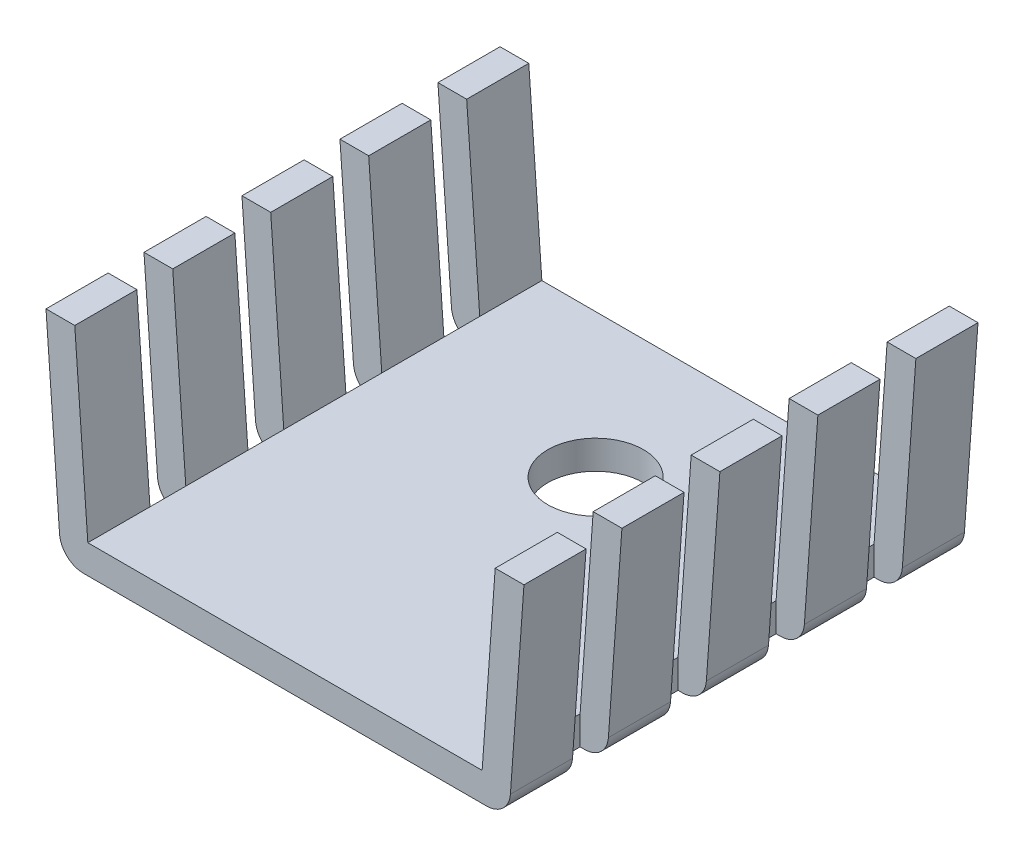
ISO-10303-21;
HEADER;
FILE_DESCRIPTION(('STEP AP214'),'2;1');
FILE_NAME('part.step','',(''),(''),'','','');
FILE_SCHEMA(('AUTOMOTIVE_DESIGN { 1 0 10303 214 1 1 1 1 }'));
ENDSEC;
DATA;
#1=APPLICATION_CONTEXT('core data for automotive mechanical design processes');
#2=APPLICATION_PROTOCOL_DEFINITION('international standard','automotive_design',2000,#1);
#3=PRODUCT_CONTEXT('',#1,'mechanical');
#4=PRODUCT('Part','Part','',(#3));
#5=PRODUCT_RELATED_PRODUCT_CATEGORY('part','',(#4));
#6=PRODUCT_DEFINITION_FORMATION('','',#4);
#7=PRODUCT_DEFINITION_CONTEXT('part definition',#1,'design');
#8=PRODUCT_DEFINITION('design','',#6,#7);
#9=PRODUCT_DEFINITION_SHAPE('','',#8);
#10=(LENGTH_UNIT() NAMED_UNIT(*) SI_UNIT(.MILLI.,.METRE.));
#11=(NAMED_UNIT(*) PLANE_ANGLE_UNIT() SI_UNIT($,.RADIAN.));
#12=(NAMED_UNIT(*) SI_UNIT($,.STERADIAN.) SOLID_ANGLE_UNIT());
#13=UNCERTAINTY_MEASURE_WITH_UNIT(LENGTH_MEASURE(1.E-05),#10,'distance_accuracy_value','');
#14=(GEOMETRIC_REPRESENTATION_CONTEXT(3) GLOBAL_UNCERTAINTY_ASSIGNED_CONTEXT((#13)) GLOBAL_UNIT_ASSIGNED_CONTEXT((#10,
#11,#12)) REPRESENTATION_CONTEXT('',''));
#15=CARTESIAN_POINT('',(0.,0.,0.));
#16=DIRECTION('',(0.,0.,1.));
#17=DIRECTION('',(1.,0.,0.));
#18=AXIS2_PLACEMENT_3D('',#15,#16,#17);
#19=CARTESIAN_POINT('',(-10.,8.79999999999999,19.));
#20=DIRECTION('',(0.997420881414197,0.0717745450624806,0.));
#21=DIRECTION('',(-0.0717745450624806,0.997420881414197,0.));
#22=AXIS2_PLACEMENT_3D('',#19,#20,#21);
#23=PLANE('',#22);
#24=DIRECTION('',(0.,0.,-1.));
#25=VECTOR('',#24,1.);
#26=CARTESIAN_POINT('',(-9.43354601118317,0.92822545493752,19.));
#27=LINE('',#26,#25);
#28=CARTESIAN_POINT('',(-9.43354601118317,0.92822545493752,2.6));
#29=VERTEX_POINT('',#28);
#30=CARTESIAN_POINT('',(-9.43354601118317,0.92822545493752,0.));
#31=VERTEX_POINT('',#30);
#32=EDGE_CURVE('E208',#29,#31,#27,.T.);
#33=ORIENTED_EDGE('',*,*,#32,.F.);
#34=DIRECTION('',(-0.0717745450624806,0.997420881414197,0.));
#35=VECTOR('',#34,1.);
#36=CARTESIAN_POINT('',(-10.,8.79999999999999,2.6));
#37=LINE('',#36,#35);
#38=CARTESIAN_POINT('',(-10.,8.79999999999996,2.6));
#39=VERTEX_POINT('',#38);
#40=EDGE_CURVE('E462',#29,#39,#37,.T.);
#41=ORIENTED_EDGE('',*,*,#40,.T.);
#42=DIRECTION('',(0.,0.,-1.));
#43=VECTOR('',#42,1.);
#44=CARTESIAN_POINT('',(-10.,8.79999999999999,19.));
#45=LINE('',#44,#43);
#46=CARTESIAN_POINT('',(-10.,8.79999999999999,0.));
#47=VERTEX_POINT('',#46);
#48=EDGE_CURVE('E213',#39,#47,#45,.T.);
#49=ORIENTED_EDGE('',*,*,#48,.T.);
#50=DIRECTION('',(0.0717745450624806,-0.997420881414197,0.));
#51=VECTOR('',#50,1.);
#52=CARTESIAN_POINT('',(-10.,8.79999999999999,0.));
#53=LINE('',#52,#51);
#54=EDGE_CURVE('E168',#47,#31,#53,.T.);
#55=ORIENTED_EDGE('',*,*,#54,.T.);
#56=EDGE_LOOP('',(#33,#41,#49,#55));
#57=FACE_BOUND('',#56,.T.);
#58=ADVANCED_FACE('F33',(#57),#23,.F.);
#59=CARTESIAN_POINT('',(-8.43612512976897,0.999999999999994,19.));
#60=DIRECTION('',(0.,0.,-1.));
#61=DIRECTION('',(-1.,0.,0.));
#62=AXIS2_PLACEMENT_3D('',#59,#60,#61);
#63=CYLINDRICAL_SURFACE('',#62,1.);
#64=DIRECTION('',(0.,0.,-1.));
#65=VECTOR('',#64,1.);
#66=CARTESIAN_POINT('',(-8.43612512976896,0.,19.));
#67=LINE('',#66,#65);
#68=CARTESIAN_POINT('',(-8.43612512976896,0.,2.6));
#69=VERTEX_POINT('',#68);
#70=CARTESIAN_POINT('',(-8.43612512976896,0.,0.));
#71=VERTEX_POINT('',#70);
#72=EDGE_CURVE('E203',#69,#71,#67,.T.);
#73=ORIENTED_EDGE('',*,*,#72,.F.);
#74=CARTESIAN_POINT('',(-8.43612512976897,0.999999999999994,2.6));
#75=DIRECTION('',(0.,0.,-1.));
#76=DIRECTION('',(-1.,0.,0.));
#77=AXIS2_PLACEMENT_3D('',#74,#75,#76);
#78=CIRCLE('',#77,1.);
#79=EDGE_CURVE('E857',#69,#29,#78,.T.);
#80=ORIENTED_EDGE('',*,*,#79,.T.);
#81=ORIENTED_EDGE('',*,*,#32,.T.);
#82=CARTESIAN_POINT('',(-8.43612512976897,0.999999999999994,0.));
#83=DIRECTION('',(0.,0.,1.));
#84=DIRECTION('',(1.,0.,0.));
#85=AXIS2_PLACEMENT_3D('',#82,#83,#84);
#86=CIRCLE('',#85,1.);
#87=EDGE_CURVE('E171',#31,#71,#86,.T.);
#88=ORIENTED_EDGE('',*,*,#87,.T.);
#89=EDGE_LOOP('',(#73,#80,#81,#88));
#90=FACE_BOUND('',#89,.T.);
#91=ADVANCED_FACE('F855',(#90),#63,.T.);
#92=DIRECTION('',(0.0717745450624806,-0.997420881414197,0.));
#93=VECTOR('',#92,1.);
#94=CARTESIAN_POINT('',(-10.,8.79999999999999,8.2));
#95=LINE('',#94,#93);
#96=CARTESIAN_POINT('',(-10.,8.79999999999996,8.2));
#97=VERTEX_POINT('',#96);
#98=CARTESIAN_POINT('',(-9.43354601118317,0.92822545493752,8.2));
#99=VERTEX_POINT('',#98);
#100=EDGE_CURVE('E477',#97,#99,#95,.T.);
#101=ORIENTED_EDGE('',*,*,#100,.T.);
#102=CARTESIAN_POINT('',(-9.43354601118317,0.92822545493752,10.8));
#103=VERTEX_POINT('',#102);
#104=EDGE_CURVE('E294',#103,#99,#27,.T.);
#105=ORIENTED_EDGE('',*,*,#104,.F.);
#106=DIRECTION('',(-0.0717745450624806,0.997420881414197,0.));
#107=VECTOR('',#106,1.);
#108=CARTESIAN_POINT('',(-10.,8.79999999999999,10.8));
#109=LINE('',#108,#107);
#110=CARTESIAN_POINT('',(-10.,8.79999999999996,10.8));
#111=VERTEX_POINT('',#110);
#112=EDGE_CURVE('E507',#103,#111,#109,.T.);
#113=ORIENTED_EDGE('',*,*,#112,.T.);
#114=EDGE_CURVE('E820',#111,#97,#45,.T.);
#115=ORIENTED_EDGE('',*,*,#114,.T.);
#116=EDGE_LOOP('',(#101,#105,#113,#115));
#117=FACE_BOUND('',#116,.T.);
#118=ADVANCED_FACE('F1038',(#117),#23,.F.);
#119=ORIENTED_EDGE('',*,*,#104,.T.);
#120=CARTESIAN_POINT('',(-8.43612512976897,0.999999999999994,8.2));
#121=DIRECTION('',(0.,0.,1.));
#122=DIRECTION('',(1.,0.,0.));
#123=AXIS2_PLACEMENT_3D('',#120,#121,#122);
#124=CIRCLE('',#123,1.);
#125=CARTESIAN_POINT('',(-8.43612512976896,0.,8.2));
#126=VERTEX_POINT('',#125);
#127=EDGE_CURVE('E283',#99,#126,#124,.T.);
#128=ORIENTED_EDGE('',*,*,#127,.T.);
#129=CARTESIAN_POINT('',(-8.43612512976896,0.,10.8));
#130=VERTEX_POINT('',#129);
#131=EDGE_CURVE('E272',#130,#126,#67,.T.);
#132=ORIENTED_EDGE('',*,*,#131,.F.);
#133=CARTESIAN_POINT('',(-8.43612512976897,0.999999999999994,10.8));
#134=DIRECTION('',(0.,0.,-1.));
#135=DIRECTION('',(-1.,0.,0.));
#136=AXIS2_PLACEMENT_3D('',#133,#134,#135);
#137=CIRCLE('',#136,1.);
#138=EDGE_CURVE('E313',#130,#103,#137,.T.);
#139=ORIENTED_EDGE('',*,*,#138,.T.);
#140=EDGE_LOOP('',(#119,#128,#132,#139));
#141=FACE_BOUND('',#140,.T.);
#142=ADVANCED_FACE('F290',(#141),#63,.T.);
#143=DIRECTION('',(0.0717745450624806,-0.997420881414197,0.));
#144=VECTOR('',#143,1.);
#145=CARTESIAN_POINT('',(-10.,8.79999999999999,12.3));
#146=LINE('',#145,#144);
#147=CARTESIAN_POINT('',(-10.,8.79999999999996,12.3));
#148=VERTEX_POINT('',#147);
#149=CARTESIAN_POINT('',(-9.43354601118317,0.92822545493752,12.3));
#150=VERTEX_POINT('',#149);
#151=EDGE_CURVE('E522',#148,#150,#146,.T.);
#152=ORIENTED_EDGE('',*,*,#151,.T.);
#153=CARTESIAN_POINT('',(-9.43354601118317,0.92822545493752,14.9));
#154=VERTEX_POINT('',#153);
#155=EDGE_CURVE('E214',#154,#150,#27,.T.);
#156=ORIENTED_EDGE('',*,*,#155,.F.);
#157=DIRECTION('',(-0.0717745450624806,0.997420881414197,0.));
#158=VECTOR('',#157,1.);
#159=CARTESIAN_POINT('',(-10.,8.79999999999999,14.9));
#160=LINE('',#159,#158);
#161=CARTESIAN_POINT('',(-10.,8.79999999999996,14.9));
#162=VERTEX_POINT('',#161);
#163=EDGE_CURVE('E537',#154,#162,#160,.T.);
#164=ORIENTED_EDGE('',*,*,#163,.T.);
#165=EDGE_CURVE('E219',#162,#148,#45,.T.);
#166=ORIENTED_EDGE('',*,*,#165,.T.);
#167=EDGE_LOOP('',(#152,#156,#164,#166));
#168=FACE_BOUND('',#167,.T.);
#169=ADVANCED_FACE('F829',(#168),#23,.F.);
#170=ORIENTED_EDGE('',*,*,#155,.T.);
#171=CARTESIAN_POINT('',(-8.43612512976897,0.999999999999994,12.3));
#172=DIRECTION('',(0.,0.,1.));
#173=DIRECTION('',(1.,0.,0.));
#174=AXIS2_PLACEMENT_3D('',#171,#172,#173);
#175=CIRCLE('',#174,1.);
#176=CARTESIAN_POINT('',(-8.43612512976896,0.,12.3));
#177=VERTEX_POINT('',#176);
#178=EDGE_CURVE('E317',#150,#177,#175,.T.);
#179=ORIENTED_EDGE('',*,*,#178,.T.);
#180=CARTESIAN_POINT('',(-8.43612512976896,0.,14.9));
#181=VERTEX_POINT('',#180);
#182=EDGE_CURVE('E209',#181,#177,#67,.T.);
#183=ORIENTED_EDGE('',*,*,#182,.F.);
#184=CARTESIAN_POINT('',(-8.43612512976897,0.999999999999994,14.9));
#185=DIRECTION('',(0.,0.,-1.));
#186=DIRECTION('',(-1.,0.,0.));
#187=AXIS2_PLACEMENT_3D('',#184,#185,#186);
#188=CIRCLE('',#187,1.);
#189=EDGE_CURVE('E405',#181,#154,#188,.T.);
#190=ORIENTED_EDGE('',*,*,#189,.T.);
#191=EDGE_LOOP('',(#170,#179,#183,#190));
#192=FACE_BOUND('',#191,.T.);
#193=ADVANCED_FACE('F845',(#192),#63,.T.);
#194=CARTESIAN_POINT('',(8.43612512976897,1.,19.));
#195=DIRECTION('',(0.,0.,-1.));
#196=DIRECTION('',(-1.,0.,0.));
#197=AXIS2_PLACEMENT_3D('',#194,#195,#196);
#198=CYLINDRICAL_SURFACE('',#197,1.);
#199=DIRECTION('',(0.,0.,-1.));
#200=VECTOR('',#199,1.);
#201=CARTESIAN_POINT('',(9.43354601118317,0.928225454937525,19.));
#202=LINE('',#201,#200);
#203=CARTESIAN_POINT('',(9.43354601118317,0.928225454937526,14.9));
#204=VERTEX_POINT('',#203);
#205=CARTESIAN_POINT('',(9.43354601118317,0.928225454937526,12.3));
#206=VERTEX_POINT('',#205);
#207=EDGE_CURVE('E199',#204,#206,#202,.T.);
#208=ORIENTED_EDGE('',*,*,#207,.F.);
#209=CARTESIAN_POINT('',(8.43612512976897,1.,14.9));
#210=DIRECTION('',(0.,0.,-1.));
#211=DIRECTION('',(-1.,0.,0.));
#212=AXIS2_PLACEMENT_3D('',#209,#210,#211);
#213=CIRCLE('',#212,1.);
#214=CARTESIAN_POINT('',(8.43612512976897,0.,14.9));
#215=VERTEX_POINT('',#214);
#216=EDGE_CURVE('E341',#204,#215,#213,.T.);
#217=ORIENTED_EDGE('',*,*,#216,.T.);
#218=DIRECTION('',(0.,0.,-1.));
#219=VECTOR('',#218,1.);
#220=CARTESIAN_POINT('',(8.43612512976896,0.,19.));
#221=LINE('',#220,#219);
#222=CARTESIAN_POINT('',(8.43612512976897,0.,12.3));
#223=VERTEX_POINT('',#222);
#224=EDGE_CURVE('E204',#215,#223,#221,.T.);
#225=ORIENTED_EDGE('',*,*,#224,.T.);
#226=CARTESIAN_POINT('',(8.43612512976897,1.,12.3));
#227=DIRECTION('',(0.,0.,1.));
#228=DIRECTION('',(1.,0.,0.));
#229=AXIS2_PLACEMENT_3D('',#226,#227,#228);
#230=CIRCLE('',#229,1.);
#231=EDGE_CURVE('E360',#223,#206,#230,.T.);
#232=ORIENTED_EDGE('',*,*,#231,.T.);
#233=EDGE_LOOP('',(#208,#217,#225,#232));
#234=FACE_BOUND('',#233,.T.);
#235=ADVANCED_FACE('F1090',(#234),#198,.T.);
#236=CARTESIAN_POINT('',(10.,8.8,19.));
#237=DIRECTION('',(-0.997420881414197,0.0717745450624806,0.));
#238=DIRECTION('',(-0.0717745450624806,-0.997420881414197,0.));
#239=AXIS2_PLACEMENT_3D('',#236,#237,#238);
#240=PLANE('',#239);
#241=DIRECTION('',(-0.0717745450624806,-0.997420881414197,0.));
#242=VECTOR('',#241,1.);
#243=CARTESIAN_POINT('',(10.,8.8,14.9));
#244=LINE('',#243,#242);
#245=CARTESIAN_POINT('',(10.,8.8,14.9));
#246=VERTEX_POINT('',#245);
#247=EDGE_CURVE('E534',#246,#204,#244,.T.);
#248=ORIENTED_EDGE('',*,*,#247,.T.);
#249=ORIENTED_EDGE('',*,*,#207,.T.);
#250=DIRECTION('',(0.0717745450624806,0.997420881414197,0.));
#251=VECTOR('',#250,1.);
#252=CARTESIAN_POINT('',(10.,8.8,12.3));
#253=LINE('',#252,#251);
#254=CARTESIAN_POINT('',(10.,8.8,12.3));
#255=VERTEX_POINT('',#254);
#256=EDGE_CURVE('E519',#206,#255,#253,.T.);
#257=ORIENTED_EDGE('',*,*,#256,.T.);
#258=DIRECTION('',(0.,0.,-1.));
#259=VECTOR('',#258,1.);
#260=CARTESIAN_POINT('',(10.,8.8,19.));
#261=LINE('',#260,#259);
#262=EDGE_CURVE('E149',#246,#255,#261,.T.);
#263=ORIENTED_EDGE('',*,*,#262,.F.);
#264=EDGE_LOOP('',(#248,#249,#257,#263));
#265=FACE_BOUND('',#264,.T.);
#266=ADVANCED_FACE('F992',(#265),#240,.F.);
#267=CARTESIAN_POINT('',(9.43354601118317,0.928225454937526,10.8));
#268=VERTEX_POINT('',#267);
#269=CARTESIAN_POINT('',(9.43354601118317,0.928225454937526,8.2));
#270=VERTEX_POINT('',#269);
#271=EDGE_CURVE('E996',#268,#270,#202,.T.);
#272=ORIENTED_EDGE('',*,*,#271,.F.);
#273=CARTESIAN_POINT('',(8.43612512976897,1.,10.8));
#274=DIRECTION('',(0.,0.,-1.));
#275=DIRECTION('',(-1.,0.,0.));
#276=AXIS2_PLACEMENT_3D('',#273,#274,#275);
#277=CIRCLE('',#276,1.);
#278=CARTESIAN_POINT('',(8.43612512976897,0.,10.8));
#279=VERTEX_POINT('',#278);
#280=EDGE_CURVE('E365',#268,#279,#277,.T.);
#281=ORIENTED_EDGE('',*,*,#280,.T.);
#282=CARTESIAN_POINT('',(8.43612512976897,0.,8.2));
#283=VERTEX_POINT('',#282);
#284=EDGE_CURVE('E1009',#279,#283,#221,.T.);
#285=ORIENTED_EDGE('',*,*,#284,.T.);
#286=CARTESIAN_POINT('',(8.43612512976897,1.,8.2));
#287=DIRECTION('',(0.,0.,1.));
#288=DIRECTION('',(1.,0.,0.));
#289=AXIS2_PLACEMENT_3D('',#286,#287,#288);
#290=CIRCLE('',#289,1.);
#291=EDGE_CURVE('E384',#283,#270,#290,.T.);
#292=ORIENTED_EDGE('',*,*,#291,.T.);
#293=EDGE_LOOP('',(#272,#281,#285,#292));
#294=FACE_BOUND('',#293,.T.);
#295=ADVANCED_FACE('F1092',(#294),#198,.T.);
#296=DIRECTION('',(-0.0717745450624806,-0.997420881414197,0.));
#297=VECTOR('',#296,1.);
#298=CARTESIAN_POINT('',(10.,8.8,10.8));
#299=LINE('',#298,#297);
#300=CARTESIAN_POINT('',(10.,8.8,10.8));
#301=VERTEX_POINT('',#300);
#302=EDGE_CURVE('E504',#301,#268,#299,.T.);
#303=ORIENTED_EDGE('',*,*,#302,.T.);
#304=ORIENTED_EDGE('',*,*,#271,.T.);
#305=DIRECTION('',(0.0717745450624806,0.997420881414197,0.));
#306=VECTOR('',#305,1.);
#307=CARTESIAN_POINT('',(10.,8.8,8.2));
#308=LINE('',#307,#306);
#309=CARTESIAN_POINT('',(10.,8.8,8.2));
#310=VERTEX_POINT('',#309);
#311=EDGE_CURVE('E474',#270,#310,#308,.T.);
#312=ORIENTED_EDGE('',*,*,#311,.T.);
#313=EDGE_CURVE('E964',#301,#310,#261,.T.);
#314=ORIENTED_EDGE('',*,*,#313,.F.);
#315=EDGE_LOOP('',(#303,#304,#312,#314));
#316=FACE_BOUND('',#315,.T.);
#317=ADVANCED_FACE('F1033',(#316),#240,.F.);
#318=CARTESIAN_POINT('',(9.43354601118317,0.928225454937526,6.7));
#319=VERTEX_POINT('',#318);
#320=CARTESIAN_POINT('',(9.43354601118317,0.928225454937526,4.1));
#321=VERTEX_POINT('',#320);
#322=EDGE_CURVE('E997',#319,#321,#202,.T.);
#323=ORIENTED_EDGE('',*,*,#322,.F.);
#324=CARTESIAN_POINT('',(8.43612512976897,1.,6.7));
#325=DIRECTION('',(0.,0.,-1.));
#326=DIRECTION('',(-1.,0.,0.));
#327=AXIS2_PLACEMENT_3D('',#324,#325,#326);
#328=CIRCLE('',#327,1.);
#329=CARTESIAN_POINT('',(8.43612512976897,0.,6.7));
#330=VERTEX_POINT('',#329);
#331=EDGE_CURVE('E389',#319,#330,#328,.T.);
#332=ORIENTED_EDGE('',*,*,#331,.T.);
#333=CARTESIAN_POINT('',(8.43612512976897,0.,4.1));
#334=VERTEX_POINT('',#333);
#335=EDGE_CURVE('E1008',#330,#334,#221,.T.);
#336=ORIENTED_EDGE('',*,*,#335,.T.);
#337=CARTESIAN_POINT('',(8.43612512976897,1.,4.1));
#338=DIRECTION('',(0.,0.,1.));
#339=DIRECTION('',(1.,0.,0.));
#340=AXIS2_PLACEMENT_3D('',#337,#338,#339);
#341=CIRCLE('',#340,1.);
#342=EDGE_CURVE('E429',#334,#321,#341,.T.);
#343=ORIENTED_EDGE('',*,*,#342,.T.);
#344=EDGE_LOOP('',(#323,#332,#336,#343));
#345=FACE_BOUND('',#344,.T.);
#346=ADVANCED_FACE('F1006',(#345),#198,.T.);
#347=DIRECTION('',(-0.0717745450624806,-0.997420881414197,0.));
#348=VECTOR('',#347,1.);
#349=CARTESIAN_POINT('',(10.,8.8,6.7));
#350=LINE('',#349,#348);
#351=CARTESIAN_POINT('',(10.,8.8,6.7));
#352=VERTEX_POINT('',#351);
#353=EDGE_CURVE('E489',#352,#319,#350,.T.);
#354=ORIENTED_EDGE('',*,*,#353,.T.);
#355=ORIENTED_EDGE('',*,*,#322,.T.);
#356=DIRECTION('',(0.0717745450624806,0.997420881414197,0.));
#357=VECTOR('',#356,1.);
#358=CARTESIAN_POINT('',(10.,8.8,4.1));
#359=LINE('',#358,#357);
#360=CARTESIAN_POINT('',(10.,8.8,4.1));
#361=VERTEX_POINT('',#360);
#362=EDGE_CURVE('E246',#321,#361,#359,.T.);
#363=ORIENTED_EDGE('',*,*,#362,.T.);
#364=EDGE_CURVE('E962',#352,#361,#261,.T.);
#365=ORIENTED_EDGE('',*,*,#364,.F.);
#366=EDGE_LOOP('',(#354,#355,#363,#365));
#367=FACE_BOUND('',#366,.T.);
#368=ADVANCED_FACE('F1002',(#367),#240,.F.);
#369=DIRECTION('',(0.0717745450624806,-0.997420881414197,0.));
#370=VECTOR('',#369,1.);
#371=CARTESIAN_POINT('',(-10.,8.79999999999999,16.4));
#372=LINE('',#371,#370);
#373=CARTESIAN_POINT('',(-10.,8.79999999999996,16.4));
#374=VERTEX_POINT('',#373);
#375=CARTESIAN_POINT('',(-9.43354601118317,0.92822545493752,16.4));
#376=VERTEX_POINT('',#375);
#377=EDGE_CURVE('E549',#374,#376,#372,.T.);
#378=ORIENTED_EDGE('',*,*,#377,.T.);
#379=CARTESIAN_POINT('',(-9.43354601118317,0.92822545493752,19.));
#380=VERTEX_POINT('',#379);
#381=EDGE_CURVE('E210',#380,#376,#27,.T.);
#382=ORIENTED_EDGE('',*,*,#381,.F.);
#383=DIRECTION('',(0.0717745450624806,-0.997420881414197,0.));
#384=VECTOR('',#383,1.);
#385=CARTESIAN_POINT('',(-10.,8.79999999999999,19.));
#386=LINE('',#385,#384);
#387=CARTESIAN_POINT('',(-10.,8.79999999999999,19.));
#388=VERTEX_POINT('',#387);
#389=EDGE_CURVE('E561',#388,#380,#386,.T.);
#390=ORIENTED_EDGE('',*,*,#389,.F.);
#391=EDGE_CURVE('E215',#388,#374,#45,.T.);
#392=ORIENTED_EDGE('',*,*,#391,.T.);
#393=EDGE_LOOP('',(#378,#382,#390,#392));
#394=FACE_BOUND('',#393,.T.);
#395=ADVANCED_FACE('F1022',(#394),#23,.F.);
#396=ORIENTED_EDGE('',*,*,#381,.T.);
#397=CARTESIAN_POINT('',(-8.43612512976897,0.999999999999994,16.4));
#398=DIRECTION('',(0.,0.,1.));
#399=DIRECTION('',(1.,0.,0.));
#400=AXIS2_PLACEMENT_3D('',#397,#398,#399);
#401=CIRCLE('',#400,1.);
#402=CARTESIAN_POINT('',(-8.43612512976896,0.,16.4));
#403=VERTEX_POINT('',#402);
#404=EDGE_CURVE('E410',#376,#403,#401,.T.);
#405=ORIENTED_EDGE('',*,*,#404,.T.);
#406=CARTESIAN_POINT('',(-8.43612512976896,0.,19.));
#407=VERTEX_POINT('',#406);
#408=EDGE_CURVE('E205',#407,#403,#67,.T.);
#409=ORIENTED_EDGE('',*,*,#408,.F.);
#410=CARTESIAN_POINT('',(-8.43612512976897,0.999999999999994,19.));
#411=DIRECTION('',(0.,0.,1.));
#412=DIRECTION('',(1.,0.,0.));
#413=AXIS2_PLACEMENT_3D('',#410,#411,#412);
#414=CIRCLE('',#413,1.);
#415=EDGE_CURVE('E563',#380,#407,#414,.T.);
#416=ORIENTED_EDGE('',*,*,#415,.F.);
#417=EDGE_LOOP('',(#396,#405,#409,#416));
#418=FACE_BOUND('',#417,.T.);
#419=ADVANCED_FACE('F1020',(#418),#63,.T.);
#420=CARTESIAN_POINT('',(9.43354601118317,0.928225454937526,2.6));
#421=VERTEX_POINT('',#420);
#422=CARTESIAN_POINT('',(9.43354601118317,0.928225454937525,0.));
#423=VERTEX_POINT('',#422);
#424=EDGE_CURVE('E148',#421,#423,#202,.T.);
#425=ORIENTED_EDGE('',*,*,#424,.F.);
#426=CARTESIAN_POINT('',(8.43612512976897,1.,2.6));
#427=DIRECTION('',(0.,0.,-1.));
#428=DIRECTION('',(-1.,0.,0.));
#429=AXIS2_PLACEMENT_3D('',#426,#427,#428);
#430=CIRCLE('',#429,1.);
#431=CARTESIAN_POINT('',(8.43612512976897,0.,2.6));
#432=VERTEX_POINT('',#431);
#433=EDGE_CURVE('E434',#421,#432,#430,.T.);
#434=ORIENTED_EDGE('',*,*,#433,.T.);
#435=CARTESIAN_POINT('',(8.43612512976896,0.,0.));
#436=VERTEX_POINT('',#435);
#437=EDGE_CURVE('E198',#432,#436,#221,.T.);
#438=ORIENTED_EDGE('',*,*,#437,.T.);
#439=CARTESIAN_POINT('',(8.43612512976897,1.,0.));
#440=DIRECTION('',(0.,0.,1.));
#441=DIRECTION('',(-1.,0.,0.));
#442=AXIS2_PLACEMENT_3D('',#439,#440,#441);
#443=CIRCLE('',#442,1.);
#444=EDGE_CURVE('E177',#436,#423,#443,.T.);
#445=ORIENTED_EDGE('',*,*,#444,.T.);
#446=EDGE_LOOP('',(#425,#434,#438,#445));
#447=FACE_BOUND('',#446,.T.);
#448=ADVANCED_FACE('F1012',(#447),#198,.T.);
#449=DIRECTION('',(-0.0717745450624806,-0.997420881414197,0.));
#450=VECTOR('',#449,1.);
#451=CARTESIAN_POINT('',(10.,8.8,2.6));
#452=LINE('',#451,#450);
#453=CARTESIAN_POINT('',(10.,8.79999999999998,2.6));
#454=VERTEX_POINT('',#453);
#455=EDGE_CURVE('E248',#454,#421,#452,.T.);
#456=ORIENTED_EDGE('',*,*,#455,.T.);
#457=ORIENTED_EDGE('',*,*,#424,.T.);
#458=DIRECTION('',(0.0717745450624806,0.997420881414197,0.));
#459=VECTOR('',#458,1.);
#460=CARTESIAN_POINT('',(10.,8.8,0.));
#461=LINE('',#460,#459);
#462=CARTESIAN_POINT('',(10.,8.8,0.));
#463=VERTEX_POINT('',#462);
#464=EDGE_CURVE('E180',#423,#463,#461,.T.);
#465=ORIENTED_EDGE('',*,*,#464,.T.);
#466=EDGE_CURVE('E151',#454,#463,#261,.T.);
#467=ORIENTED_EDGE('',*,*,#466,.F.);
#468=EDGE_LOOP('',(#456,#457,#465,#467));
#469=FACE_BOUND('',#468,.T.);
#470=ADVANCED_FACE('F974',(#469),#240,.F.);
#471=CARTESIAN_POINT('',(-8.25,1.19999999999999,19.));
#472=DIRECTION('',(-0.997420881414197,-0.07177454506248,0.));
#473=DIRECTION('',(0.07177454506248,-0.997420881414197,0.));
#474=AXIS2_PLACEMENT_3D('',#471,#472,#473);
#475=PLANE('',#474);
#476=DIRECTION('',(0.,0.,-1.));
#477=VECTOR('',#476,1.);
#478=CARTESIAN_POINT('',(-8.79689705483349,8.79999999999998,19.));
#479=LINE('',#478,#477);
#480=CARTESIAN_POINT('',(-8.79689705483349,8.79999999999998,2.6));
#481=VERTEX_POINT('',#480);
#482=CARTESIAN_POINT('',(-8.79689705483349,8.79999999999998,0.));
#483=VERTEX_POINT('',#482);
#484=EDGE_CURVE('E218',#481,#483,#479,.T.);
#485=ORIENTED_EDGE('',*,*,#484,.F.);
#486=DIRECTION('',(0.07177454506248,-0.997420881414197,0.));
#487=VECTOR('',#486,1.);
#488=CARTESIAN_POINT('',(-8.25,1.19999999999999,2.6));
#489=LINE('',#488,#487);
#490=CARTESIAN_POINT('',(-8.25,1.19999999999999,2.6));
#491=VERTEX_POINT('',#490);
#492=EDGE_CURVE('E468',#481,#491,#489,.T.);
#493=ORIENTED_EDGE('',*,*,#492,.T.);
#494=DIRECTION('',(0.,0.,-1.));
#495=VECTOR('',#494,1.);
#496=CARTESIAN_POINT('',(-8.25,1.19999999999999,19.));
#497=LINE('',#496,#495);
#498=CARTESIAN_POINT('',(-8.25,1.19999999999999,0.));
#499=VERTEX_POINT('',#498);
#500=EDGE_CURVE('E223',#491,#499,#497,.T.);
#501=ORIENTED_EDGE('',*,*,#500,.T.);
#502=DIRECTION('',(-0.07177454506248,0.997420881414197,0.));
#503=VECTOR('',#502,1.);
#504=CARTESIAN_POINT('',(-8.25,1.19999999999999,0.));
#505=LINE('',#504,#503);
#506=EDGE_CURVE('E161',#499,#483,#505,.T.);
#507=ORIENTED_EDGE('',*,*,#506,.T.);
#508=EDGE_LOOP('',(#485,#493,#501,#507));
#509=FACE_BOUND('',#508,.T.);
#510=ADVANCED_FACE('F808',(#509),#475,.F.);
#511=CARTESIAN_POINT('',(-8.79689705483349,8.79999999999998,19.));
#512=DIRECTION('',(0.,-1.,0.));
#513=DIRECTION('',(1.,0.,0.));
#514=AXIS2_PLACEMENT_3D('',#511,#512,#513);
#515=PLANE('',#514);
#516=ORIENTED_EDGE('',*,*,#48,.F.);
#517=DIRECTION('',(1.,0.,0.));
#518=VECTOR('',#517,1.);
#519=CARTESIAN_POINT('',(-8.79689705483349,8.79999999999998,2.6));
#520=LINE('',#519,#518);
#521=EDGE_CURVE('E465',#39,#481,#520,.T.);
#522=ORIENTED_EDGE('',*,*,#521,.T.);
#523=ORIENTED_EDGE('',*,*,#484,.T.);
#524=DIRECTION('',(-1.,0.,0.));
#525=VECTOR('',#524,1.);
#526=CARTESIAN_POINT('',(-8.79689705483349,8.79999999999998,0.));
#527=LINE('',#526,#525);
#528=EDGE_CURVE('E165',#483,#47,#527,.T.);
#529=ORIENTED_EDGE('',*,*,#528,.T.);
#530=EDGE_LOOP('',(#516,#522,#523,#529));
#531=FACE_BOUND('',#530,.T.);
#532=ADVANCED_FACE('F803',(#531),#515,.F.);
#533=CARTESIAN_POINT('',(8.79689705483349,8.8,19.));
#534=DIRECTION('',(0.,-1.,0.));
#535=DIRECTION('',(1.,0.,0.));
#536=AXIS2_PLACEMENT_3D('',#533,#534,#535);
#537=PLANE('',#536);
#538=DIRECTION('',(0.,0.,-1.));
#539=VECTOR('',#538,1.);
#540=CARTESIAN_POINT('',(8.79689705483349,8.8,19.));
#541=LINE('',#540,#539);
#542=CARTESIAN_POINT('',(8.79689705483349,8.8,2.6));
#543=VERTEX_POINT('',#542);
#544=CARTESIAN_POINT('',(8.79689705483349,8.8,0.));
#545=VERTEX_POINT('',#544);
#546=EDGE_CURVE('E192',#543,#545,#541,.T.);
#547=ORIENTED_EDGE('',*,*,#546,.F.);
#548=DIRECTION('',(1.,0.,0.));
#549=VECTOR('',#548,1.);
#550=CARTESIAN_POINT('',(8.79689705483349,8.8,2.6));
#551=LINE('',#550,#549);
#552=EDGE_CURVE('E456',#543,#454,#551,.T.);
#553=ORIENTED_EDGE('',*,*,#552,.T.);
#554=ORIENTED_EDGE('',*,*,#466,.T.);
#555=DIRECTION('',(-1.,0.,0.));
#556=VECTOR('',#555,1.);
#557=CARTESIAN_POINT('',(8.79689705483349,8.8,0.));
#558=LINE('',#557,#556);
#559=EDGE_CURVE('E183',#463,#545,#558,.T.);
#560=ORIENTED_EDGE('',*,*,#559,.T.);
#561=EDGE_LOOP('',(#547,#553,#554,#560));
#562=FACE_BOUND('',#561,.T.);
#563=ADVANCED_FACE('F969',(#562),#537,.F.);
#564=CARTESIAN_POINT('',(8.25,1.2,19.));
#565=DIRECTION('',(0.997420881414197,-0.07177454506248,0.));
#566=DIRECTION('',(0.07177454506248,0.997420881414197,0.));
#567=AXIS2_PLACEMENT_3D('',#564,#565,#566);
#568=PLANE('',#567);
#569=DIRECTION('',(0.,0.,-1.));
#570=VECTOR('',#569,1.);
#571=CARTESIAN_POINT('',(8.25,1.2,19.));
#572=LINE('',#571,#570);
#573=CARTESIAN_POINT('',(8.25,1.2,2.6));
#574=VERTEX_POINT('',#573);
#575=CARTESIAN_POINT('',(8.25,1.2,0.));
#576=VERTEX_POINT('',#575);
#577=EDGE_CURVE('E97',#574,#576,#572,.T.);
#578=ORIENTED_EDGE('',*,*,#577,.F.);
#579=DIRECTION('',(0.07177454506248,0.997420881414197,0.));
#580=VECTOR('',#579,1.);
#581=CARTESIAN_POINT('',(8.25,1.2,2.6));
#582=LINE('',#581,#580);
#583=EDGE_CURVE('E459',#574,#543,#582,.T.);
#584=ORIENTED_EDGE('',*,*,#583,.T.);
#585=ORIENTED_EDGE('',*,*,#546,.T.);
#586=DIRECTION('',(-0.07177454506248,-0.997420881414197,0.));
#587=VECTOR('',#586,1.);
#588=CARTESIAN_POINT('',(8.25,1.2,0.));
#589=LINE('',#588,#587);
#590=EDGE_CURVE('E186',#545,#576,#589,.T.);
#591=ORIENTED_EDGE('',*,*,#590,.T.);
#592=EDGE_LOOP('',(#578,#584,#585,#591));
#593=FACE_BOUND('',#592,.T.);
#594=ADVANCED_FACE('F978',(#593),#568,.F.);
#595=CARTESIAN_POINT('',(-8.25000000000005,1.19999999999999,6.7));
#596=VERTEX_POINT('',#595);
#597=CARTESIAN_POINT('',(-8.25,1.19999999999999,4.1));
#598=VERTEX_POINT('',#597);
#599=EDGE_CURVE('E894',#596,#598,#497,.T.);
#600=ORIENTED_EDGE('',*,*,#599,.T.);
#601=DIRECTION('',(-0.07177454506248,0.997420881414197,0.));
#602=VECTOR('',#601,1.);
#603=CARTESIAN_POINT('',(-8.25,1.19999999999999,4.1));
#604=LINE('',#603,#602);
#605=CARTESIAN_POINT('',(-8.79689705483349,8.79999999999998,4.1));
#606=VERTEX_POINT('',#605);
#607=EDGE_CURVE('E453',#598,#606,#604,.T.);
#608=ORIENTED_EDGE('',*,*,#607,.T.);
#609=CARTESIAN_POINT('',(-8.79689705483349,8.79999999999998,6.7));
#610=VERTEX_POINT('',#609);
#611=EDGE_CURVE('E794',#610,#606,#479,.T.);
#612=ORIENTED_EDGE('',*,*,#611,.F.);
#613=DIRECTION('',(0.07177454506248,-0.997420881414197,0.));
#614=VECTOR('',#613,1.);
#615=CARTESIAN_POINT('',(-8.25,1.19999999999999,6.7));
#616=LINE('',#615,#614);
#617=EDGE_CURVE('E498',#610,#596,#616,.T.);
#618=ORIENTED_EDGE('',*,*,#617,.T.);
#619=EDGE_LOOP('',(#600,#608,#612,#618));
#620=FACE_BOUND('',#619,.T.);
#621=ADVANCED_FACE('F892',(#620),#475,.F.);
#622=ORIENTED_EDGE('',*,*,#611,.T.);
#623=DIRECTION('',(-1.,0.,0.));
#624=VECTOR('',#623,1.);
#625=CARTESIAN_POINT('',(-8.79689705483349,8.79999999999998,4.1));
#626=LINE('',#625,#624);
#627=CARTESIAN_POINT('',(-10.,8.79999999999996,4.1));
#628=VERTEX_POINT('',#627);
#629=EDGE_CURVE('E450',#606,#628,#626,.T.);
#630=ORIENTED_EDGE('',*,*,#629,.T.);
#631=CARTESIAN_POINT('',(-10.,8.79999999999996,6.7));
#632=VERTEX_POINT('',#631);
#633=EDGE_CURVE('E818',#632,#628,#45,.T.);
#634=ORIENTED_EDGE('',*,*,#633,.F.);
#635=DIRECTION('',(1.,0.,0.));
#636=VECTOR('',#635,1.);
#637=CARTESIAN_POINT('',(-8.79689705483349,8.79999999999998,6.7));
#638=LINE('',#637,#636);
#639=EDGE_CURVE('E495',#632,#610,#638,.T.);
#640=ORIENTED_EDGE('',*,*,#639,.T.);
#641=EDGE_LOOP('',(#622,#630,#634,#640));
#642=FACE_BOUND('',#641,.T.);
#643=ADVANCED_FACE('F1052',(#642),#515,.F.);
#644=ORIENTED_EDGE('',*,*,#364,.T.);
#645=DIRECTION('',(-1.,0.,0.));
#646=VECTOR('',#645,1.);
#647=CARTESIAN_POINT('',(8.79689705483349,8.8,4.1));
#648=LINE('',#647,#646);
#649=CARTESIAN_POINT('',(8.79689705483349,8.8,4.1));
#650=VERTEX_POINT('',#649);
#651=EDGE_CURVE('E48',#361,#650,#648,.T.);
#652=ORIENTED_EDGE('',*,*,#651,.T.);
#653=CARTESIAN_POINT('',(8.79689705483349,8.8,6.7));
#654=VERTEX_POINT('',#653);
#655=EDGE_CURVE('E955',#654,#650,#541,.T.);
#656=ORIENTED_EDGE('',*,*,#655,.F.);
#657=DIRECTION('',(1.,0.,0.));
#658=VECTOR('',#657,1.);
#659=CARTESIAN_POINT('',(8.79689705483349,8.8,6.7));
#660=LINE('',#659,#658);
#661=EDGE_CURVE('E486',#654,#352,#660,.T.);
#662=ORIENTED_EDGE('',*,*,#661,.T.);
#663=EDGE_LOOP('',(#644,#652,#656,#662));
#664=FACE_BOUND('',#663,.T.);
#665=ADVANCED_FACE('F960',(#664),#537,.F.);
#666=ORIENTED_EDGE('',*,*,#655,.T.);
#667=DIRECTION('',(-0.07177454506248,-0.997420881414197,0.));
#668=VECTOR('',#667,1.);
#669=CARTESIAN_POINT('',(8.25,1.2,4.1));
#670=LINE('',#669,#668);
#671=CARTESIAN_POINT('',(8.25,1.2,4.1));
#672=VERTEX_POINT('',#671);
#673=EDGE_CURVE('E444',#650,#672,#670,.T.);
#674=ORIENTED_EDGE('',*,*,#673,.T.);
#675=CARTESIAN_POINT('',(8.25000000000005,1.2,6.7));
#676=VERTEX_POINT('',#675);
#677=EDGE_CURVE('E944',#676,#672,#572,.T.);
#678=ORIENTED_EDGE('',*,*,#677,.F.);
#679=DIRECTION('',(0.07177454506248,0.997420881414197,0.));
#680=VECTOR('',#679,1.);
#681=CARTESIAN_POINT('',(8.25,1.2,6.7));
#682=LINE('',#681,#680);
#683=EDGE_CURVE('E243',#676,#654,#682,.T.);
#684=ORIENTED_EDGE('',*,*,#683,.T.);
#685=EDGE_LOOP('',(#666,#674,#678,#684));
#686=FACE_BOUND('',#685,.T.);
#687=ADVANCED_FACE('F953',(#686),#568,.F.);
#688=CARTESIAN_POINT('',(-8.25,1.2,14.9));
#689=VERTEX_POINT('',#688);
#690=CARTESIAN_POINT('',(-8.25000000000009,1.19999999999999,12.3));
#691=VERTEX_POINT('',#690);
#692=EDGE_CURVE('E228',#689,#691,#497,.T.);
#693=ORIENTED_EDGE('',*,*,#692,.T.);
#694=DIRECTION('',(-0.07177454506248,0.997420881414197,0.));
#695=VECTOR('',#694,1.);
#696=CARTESIAN_POINT('',(-8.25,1.19999999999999,12.3));
#697=LINE('',#696,#695);
#698=CARTESIAN_POINT('',(-8.79689705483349,8.79999999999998,12.3));
#699=VERTEX_POINT('',#698);
#700=EDGE_CURVE('E528',#691,#699,#697,.T.);
#701=ORIENTED_EDGE('',*,*,#700,.T.);
#702=CARTESIAN_POINT('',(-8.79689705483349,8.79999999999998,14.9));
#703=VERTEX_POINT('',#702);
#704=EDGE_CURVE('E224',#703,#699,#479,.T.);
#705=ORIENTED_EDGE('',*,*,#704,.F.);
#706=DIRECTION('',(0.07177454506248,-0.997420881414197,0.));
#707=VECTOR('',#706,1.);
#708=CARTESIAN_POINT('',(-8.25,1.19999999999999,14.9));
#709=LINE('',#708,#707);
#710=EDGE_CURVE('E543',#703,#689,#709,.T.);
#711=ORIENTED_EDGE('',*,*,#710,.T.);
#712=EDGE_LOOP('',(#693,#701,#705,#711));
#713=FACE_BOUND('',#712,.T.);
#714=ADVANCED_FACE('F787',(#713),#475,.F.);
#715=ORIENTED_EDGE('',*,*,#704,.T.);
#716=DIRECTION('',(-1.,0.,0.));
#717=VECTOR('',#716,1.);
#718=CARTESIAN_POINT('',(-8.79689705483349,8.79999999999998,12.3));
#719=LINE('',#718,#717);
#720=EDGE_CURVE('E525',#699,#148,#719,.T.);
#721=ORIENTED_EDGE('',*,*,#720,.T.);
#722=ORIENTED_EDGE('',*,*,#165,.F.);
#723=DIRECTION('',(1.,0.,0.));
#724=VECTOR('',#723,1.);
#725=CARTESIAN_POINT('',(-8.79689705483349,8.79999999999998,14.9));
#726=LINE('',#725,#724);
#727=EDGE_CURVE('E540',#162,#703,#726,.T.);
#728=ORIENTED_EDGE('',*,*,#727,.T.);
#729=EDGE_LOOP('',(#715,#721,#722,#728));
#730=FACE_BOUND('',#729,.T.);
#731=ADVANCED_FACE('F833',(#730),#515,.F.);
#732=ORIENTED_EDGE('',*,*,#262,.T.);
#733=DIRECTION('',(-1.,0.,0.));
#734=VECTOR('',#733,1.);
#735=CARTESIAN_POINT('',(8.79689705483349,8.8,12.3));
#736=LINE('',#735,#734);
#737=CARTESIAN_POINT('',(8.79689705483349,8.8,12.3));
#738=VERTEX_POINT('',#737);
#739=EDGE_CURVE('E516',#255,#738,#736,.T.);
#740=ORIENTED_EDGE('',*,*,#739,.T.);
#741=CARTESIAN_POINT('',(8.79689705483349,8.8,14.9));
#742=VERTEX_POINT('',#741);
#743=EDGE_CURVE('E194',#742,#738,#541,.T.);
#744=ORIENTED_EDGE('',*,*,#743,.F.);
#745=DIRECTION('',(1.,0.,0.));
#746=VECTOR('',#745,1.);
#747=CARTESIAN_POINT('',(8.79689705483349,8.8,14.9));
#748=LINE('',#747,#746);
#749=EDGE_CURVE('E531',#742,#246,#748,.T.);
#750=ORIENTED_EDGE('',*,*,#749,.T.);
#751=EDGE_LOOP('',(#732,#740,#744,#750));
#752=FACE_BOUND('',#751,.T.);
#753=ADVANCED_FACE('F985',(#752),#537,.F.);
#754=ORIENTED_EDGE('',*,*,#743,.T.);
#755=DIRECTION('',(-0.07177454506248,-0.997420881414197,0.));
#756=VECTOR('',#755,1.);
#757=CARTESIAN_POINT('',(8.25,1.2,12.3));
#758=LINE('',#757,#756);
#759=CARTESIAN_POINT('',(8.25,1.2,12.3));
#760=VERTEX_POINT('',#759);
#761=EDGE_CURVE('E237',#738,#760,#758,.T.);
#762=ORIENTED_EDGE('',*,*,#761,.T.);
#763=CARTESIAN_POINT('',(8.25000000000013,1.2,14.9));
#764=VERTEX_POINT('',#763);
#765=EDGE_CURVE('E193',#764,#760,#572,.T.);
#766=ORIENTED_EDGE('',*,*,#765,.F.);
#767=DIRECTION('',(0.07177454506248,0.997420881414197,0.));
#768=VECTOR('',#767,1.);
#769=CARTESIAN_POINT('',(8.25,1.2,14.9));
#770=LINE('',#769,#768);
#771=EDGE_CURVE('E227',#764,#742,#770,.T.);
#772=ORIENTED_EDGE('',*,*,#771,.T.);
#773=EDGE_LOOP('',(#754,#762,#766,#772));
#774=FACE_BOUND('',#773,.T.);
#775=ADVANCED_FACE('F941',(#774),#568,.F.);
#776=CARTESIAN_POINT('',(-8.25,1.19999999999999,19.));
#777=VERTEX_POINT('',#776);
#778=CARTESIAN_POINT('',(-8.25000000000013,1.19999999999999,16.4));
#779=VERTEX_POINT('',#778);
#780=EDGE_CURVE('E225',#777,#779,#497,.T.);
#781=ORIENTED_EDGE('',*,*,#780,.T.);
#782=DIRECTION('',(-0.07177454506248,0.997420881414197,0.));
#783=VECTOR('',#782,1.);
#784=CARTESIAN_POINT('',(-8.25,1.19999999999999,16.4));
#785=LINE('',#784,#783);
#786=CARTESIAN_POINT('',(-8.79689705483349,8.79999999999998,16.4));
#787=VERTEX_POINT('',#786);
#788=EDGE_CURVE('E162',#779,#787,#785,.T.);
#789=ORIENTED_EDGE('',*,*,#788,.T.);
#790=CARTESIAN_POINT('',(-8.79689705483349,8.79999999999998,19.));
#791=VERTEX_POINT('',#790);
#792=EDGE_CURVE('E220',#791,#787,#479,.T.);
#793=ORIENTED_EDGE('',*,*,#792,.F.);
#794=DIRECTION('',(-0.07177454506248,0.997420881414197,0.));
#795=VECTOR('',#794,1.);
#796=CARTESIAN_POINT('',(-8.25,1.19999999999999,19.));
#797=LINE('',#796,#795);
#798=EDGE_CURVE('E106',#777,#791,#797,.T.);
#799=ORIENTED_EDGE('',*,*,#798,.F.);
#800=EDGE_LOOP('',(#781,#789,#793,#799));
#801=FACE_BOUND('',#800,.T.);
#802=ADVANCED_FACE('F767',(#801),#475,.F.);
#803=ORIENTED_EDGE('',*,*,#792,.T.);
#804=DIRECTION('',(-1.,0.,0.));
#805=VECTOR('',#804,1.);
#806=CARTESIAN_POINT('',(-8.79689705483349,8.79999999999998,16.4));
#807=LINE('',#806,#805);
#808=EDGE_CURVE('E552',#787,#374,#807,.T.);
#809=ORIENTED_EDGE('',*,*,#808,.T.);
#810=ORIENTED_EDGE('',*,*,#391,.F.);
#811=DIRECTION('',(-1.,0.,0.));
#812=VECTOR('',#811,1.);
#813=CARTESIAN_POINT('',(-8.79689705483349,8.79999999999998,19.));
#814=LINE('',#813,#812);
#815=EDGE_CURVE('E559',#791,#388,#814,.T.);
#816=ORIENTED_EDGE('',*,*,#815,.F.);
#817=EDGE_LOOP('',(#803,#809,#810,#816));
#818=FACE_BOUND('',#817,.T.);
#819=ADVANCED_FACE('F770',(#818),#515,.F.);
#820=CARTESIAN_POINT('',(10.,8.8,19.));
#821=VERTEX_POINT('',#820);
#822=CARTESIAN_POINT('',(10.,8.8,16.4));
#823=VERTEX_POINT('',#822);
#824=EDGE_CURVE('E141',#821,#823,#261,.T.);
#825=ORIENTED_EDGE('',*,*,#824,.T.);
#826=DIRECTION('',(-1.,0.,0.));
#827=VECTOR('',#826,1.);
#828=CARTESIAN_POINT('',(8.79689705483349,8.8,16.4));
#829=LINE('',#828,#827);
#830=CARTESIAN_POINT('',(8.79689705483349,8.8,16.4));
#831=VERTEX_POINT('',#830);
#832=EDGE_CURVE('E546',#823,#831,#829,.T.);
#833=ORIENTED_EDGE('',*,*,#832,.T.);
#834=CARTESIAN_POINT('',(8.79689705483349,8.8,19.));
#835=VERTEX_POINT('',#834);
#836=EDGE_CURVE('E154',#835,#831,#541,.T.);
#837=ORIENTED_EDGE('',*,*,#836,.F.);
#838=DIRECTION('',(-1.,0.,0.));
#839=VECTOR('',#838,1.);
#840=CARTESIAN_POINT('',(8.79689705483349,8.8,19.));
#841=LINE('',#840,#839);
#842=EDGE_CURVE('E131',#821,#835,#841,.T.);
#843=ORIENTED_EDGE('',*,*,#842,.F.);
#844=EDGE_LOOP('',(#825,#833,#837,#843));
#845=FACE_BOUND('',#844,.T.);
#846=ADVANCED_FACE('F152',(#845),#537,.F.);
#847=ORIENTED_EDGE('',*,*,#836,.T.);
#848=DIRECTION('',(-0.07177454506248,-0.997420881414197,0.));
#849=VECTOR('',#848,1.);
#850=CARTESIAN_POINT('',(8.25,1.2,16.4));
#851=LINE('',#850,#849);
#852=CARTESIAN_POINT('',(8.25,1.2,16.4));
#853=VERTEX_POINT('',#852);
#854=EDGE_CURVE('E231',#831,#853,#851,.T.);
#855=ORIENTED_EDGE('',*,*,#854,.T.);
#856=CARTESIAN_POINT('',(8.25,1.2,19.));
#857=VERTEX_POINT('',#856);
#858=EDGE_CURVE('E189',#857,#853,#572,.T.);
#859=ORIENTED_EDGE('',*,*,#858,.F.);
#860=DIRECTION('',(-0.07177454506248,-0.997420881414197,0.));
#861=VECTOR('',#860,1.);
#862=CARTESIAN_POINT('',(8.25,1.2,19.));
#863=LINE('',#862,#861);
#864=EDGE_CURVE('E57',#835,#857,#863,.T.);
#865=ORIENTED_EDGE('',*,*,#864,.F.);
#866=EDGE_LOOP('',(#847,#855,#859,#865));
#867=FACE_BOUND('',#866,.T.);
#868=ADVANCED_FACE('F1058',(#867),#568,.F.);
#869=CARTESIAN_POINT('',(-8.25,1.19999999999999,19.));
#870=DIRECTION('',(0.,-1.,0.));
#871=DIRECTION('',(1.,0.,0.));
#872=AXIS2_PLACEMENT_3D('',#869,#870,#871);
#873=PLANE('',#872);
#874=CARTESIAN_POINT('',(0.,1.2,6.));
#875=DIRECTION('',(0.,1.,0.));
#876=DIRECTION('',(-1.,0.,0.));
#877=AXIS2_PLACEMENT_3D('',#874,#875,#876);
#878=CIRCLE('',#877,2.);
#879=CARTESIAN_POINT('',(-2.,1.2,6.));
#880=VERTEX_POINT('',#879);
#881=EDGE_CURVE('E437',#880,#880,#878,.T.);
#882=ORIENTED_EDGE('',*,*,#881,.F.);
#883=EDGE_LOOP('',(#882));
#884=FACE_BOUND('',#883,.T.);
#885=ORIENTED_EDGE('',*,*,#500,.F.);
#886=DIRECTION('',(0.,0.,-1.));
#887=VECTOR('',#886,1.);
#888=CARTESIAN_POINT('',(-8.25,1.19999999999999,2.6));
#889=LINE('',#888,#887);
#890=EDGE_CURVE('E897',#598,#491,#889,.T.);
#891=ORIENTED_EDGE('',*,*,#890,.F.);
#892=ORIENTED_EDGE('',*,*,#599,.F.);
#893=DIRECTION('',(0.,0.,-1.));
#894=VECTOR('',#893,1.);
#895=CARTESIAN_POINT('',(-8.25000000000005,1.19999999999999,6.7));
#896=LINE('',#895,#894);
#897=CARTESIAN_POINT('',(-8.25000000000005,1.19999999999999,8.2));
#898=VERTEX_POINT('',#897);
#899=EDGE_CURVE('E864',#898,#596,#896,.T.);
#900=ORIENTED_EDGE('',*,*,#899,.F.);
#901=CARTESIAN_POINT('',(-8.25,1.2,10.8));
#902=VERTEX_POINT('',#901);
#903=EDGE_CURVE('E899',#902,#898,#497,.T.);
#904=ORIENTED_EDGE('',*,*,#903,.F.);
#905=DIRECTION('',(0.,0.,-1.));
#906=VECTOR('',#905,1.);
#907=CARTESIAN_POINT('',(-8.25000000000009,1.19999999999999,10.8));
#908=LINE('',#907,#906);
#909=EDGE_CURVE('E295',#691,#902,#908,.T.);
#910=ORIENTED_EDGE('',*,*,#909,.F.);
#911=ORIENTED_EDGE('',*,*,#692,.F.);
#912=DIRECTION('',(0.,0.,-1.));
#913=VECTOR('',#912,1.);
#914=CARTESIAN_POINT('',(-8.25000000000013,1.19999999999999,14.9));
#915=LINE('',#914,#913);
#916=EDGE_CURVE('E392',#779,#689,#915,.T.);
#917=ORIENTED_EDGE('',*,*,#916,.F.);
#918=ORIENTED_EDGE('',*,*,#780,.F.);
#919=DIRECTION('',(-1.,0.,0.));
#920=VECTOR('',#919,1.);
#921=CARTESIAN_POINT('',(-8.25,1.19999999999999,19.));
#922=LINE('',#921,#920);
#923=EDGE_CURVE('E188',#857,#777,#922,.T.);
#924=ORIENTED_EDGE('',*,*,#923,.F.);
#925=ORIENTED_EDGE('',*,*,#858,.T.);
#926=DIRECTION('',(0.,0.,1.));
#927=VECTOR('',#926,1.);
#928=CARTESIAN_POINT('',(8.25000000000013,1.2,14.9));
#929=LINE('',#928,#927);
#930=EDGE_CURVE('E320',#764,#853,#929,.T.);
#931=ORIENTED_EDGE('',*,*,#930,.F.);
#932=ORIENTED_EDGE('',*,*,#765,.T.);
#933=DIRECTION('',(0.,0.,1.));
#934=VECTOR('',#933,1.);
#935=CARTESIAN_POINT('',(8.25000000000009,1.2,10.8));
#936=LINE('',#935,#934);
#937=CARTESIAN_POINT('',(8.25000000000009,1.2,10.8));
#938=VERTEX_POINT('',#937);
#939=EDGE_CURVE('E344',#938,#760,#936,.T.);
#940=ORIENTED_EDGE('',*,*,#939,.F.);
#941=CARTESIAN_POINT('',(8.25000000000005,1.2,8.2));
#942=VERTEX_POINT('',#941);
#943=EDGE_CURVE('E942',#938,#942,#572,.T.);
#944=ORIENTED_EDGE('',*,*,#943,.T.);
#945=DIRECTION('',(0.,0.,1.));
#946=VECTOR('',#945,1.);
#947=CARTESIAN_POINT('',(8.25000000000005,1.2,6.7));
#948=LINE('',#947,#946);
#949=EDGE_CURVE('E368',#676,#942,#948,.T.);
#950=ORIENTED_EDGE('',*,*,#949,.F.);
#951=ORIENTED_EDGE('',*,*,#677,.T.);
#952=DIRECTION('',(0.,0.,1.));
#953=VECTOR('',#952,1.);
#954=CARTESIAN_POINT('',(8.25,1.2,2.6));
#955=LINE('',#954,#953);
#956=EDGE_CURVE('E413',#574,#672,#955,.T.);
#957=ORIENTED_EDGE('',*,*,#956,.F.);
#958=ORIENTED_EDGE('',*,*,#577,.T.);
#959=DIRECTION('',(-1.,0.,0.));
#960=VECTOR('',#959,1.);
#961=CARTESIAN_POINT('',(-8.25,1.19999999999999,0.));
#962=LINE('',#961,#960);
#963=EDGE_CURVE('E159',#576,#499,#962,.T.);
#964=ORIENTED_EDGE('',*,*,#963,.T.);
#965=EDGE_LOOP('',(#885,#891,#892,#900,#904,#910,#911,#917,#918,#924,#925,#931,#932,#940,#944,
#950,#951,#957,#958,#964));
#966=FACE_BOUND('',#965,.T.);
#967=ADVANCED_FACE('F35',(#884,#966),#873,.F.);
#968=ORIENTED_EDGE('',*,*,#903,.T.);
#969=DIRECTION('',(-0.07177454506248,0.997420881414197,0.));
#970=VECTOR('',#969,1.);
#971=CARTESIAN_POINT('',(-8.25,1.19999999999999,8.2));
#972=LINE('',#971,#970);
#973=CARTESIAN_POINT('',(-8.79689705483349,8.79999999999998,8.2));
#974=VERTEX_POINT('',#973);
#975=EDGE_CURVE('E483',#898,#974,#972,.T.);
#976=ORIENTED_EDGE('',*,*,#975,.T.);
#977=CARTESIAN_POINT('',(-8.79689705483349,8.79999999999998,10.8));
#978=VERTEX_POINT('',#977);
#979=EDGE_CURVE('E792',#978,#974,#479,.T.);
#980=ORIENTED_EDGE('',*,*,#979,.F.);
#981=DIRECTION('',(0.07177454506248,-0.997420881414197,0.));
#982=VECTOR('',#981,1.);
#983=CARTESIAN_POINT('',(-8.25,1.19999999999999,10.8));
#984=LINE('',#983,#982);
#985=EDGE_CURVE('E513',#978,#902,#984,.T.);
#986=ORIENTED_EDGE('',*,*,#985,.T.);
#987=EDGE_LOOP('',(#968,#976,#980,#986));
#988=FACE_BOUND('',#987,.T.);
#989=ADVANCED_FACE('F902',(#988),#475,.F.);
#990=ORIENTED_EDGE('',*,*,#979,.T.);
#991=DIRECTION('',(-1.,0.,0.));
#992=VECTOR('',#991,1.);
#993=CARTESIAN_POINT('',(-8.79689705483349,8.79999999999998,8.2));
#994=LINE('',#993,#992);
#995=EDGE_CURVE('E480',#974,#97,#994,.T.);
#996=ORIENTED_EDGE('',*,*,#995,.T.);
#997=ORIENTED_EDGE('',*,*,#114,.F.);
#998=DIRECTION('',(1.,0.,0.));
#999=VECTOR('',#998,1.);
#1000=CARTESIAN_POINT('',(-8.79689705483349,8.79999999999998,10.8));
#1001=LINE('',#1000,#999);
#1002=EDGE_CURVE('E510',#111,#978,#1001,.T.);
#1003=ORIENTED_EDGE('',*,*,#1002,.T.);
#1004=EDGE_LOOP('',(#990,#996,#997,#1003));
#1005=FACE_BOUND('',#1004,.T.);
#1006=ADVANCED_FACE('F1036',(#1005),#515,.F.);
#1007=DIRECTION('',(0.0717745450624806,-0.997420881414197,0.));
#1008=VECTOR('',#1007,1.);
#1009=CARTESIAN_POINT('',(-10.,8.79999999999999,4.1));
#1010=LINE('',#1009,#1008);
#1011=CARTESIAN_POINT('',(-9.43354601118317,0.92822545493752,4.1));
#1012=VERTEX_POINT('',#1011);
#1013=EDGE_CURVE('E447',#628,#1012,#1010,.T.);
#1014=ORIENTED_EDGE('',*,*,#1013,.T.);
#1015=CARTESIAN_POINT('',(-9.43354601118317,0.92822545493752,6.7));
#1016=VERTEX_POINT('',#1015);
#1017=EDGE_CURVE('E846',#1016,#1012,#27,.T.);
#1018=ORIENTED_EDGE('',*,*,#1017,.F.);
#1019=DIRECTION('',(-0.0717745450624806,0.997420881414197,0.));
#1020=VECTOR('',#1019,1.);
#1021=CARTESIAN_POINT('',(-10.,8.79999999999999,6.7));
#1022=LINE('',#1021,#1020);
#1023=EDGE_CURVE('E492',#1016,#632,#1022,.T.);
#1024=ORIENTED_EDGE('',*,*,#1023,.T.);
#1025=ORIENTED_EDGE('',*,*,#633,.T.);
#1026=EDGE_LOOP('',(#1014,#1018,#1024,#1025));
#1027=FACE_BOUND('',#1026,.T.);
#1028=ADVANCED_FACE('F1025',(#1027),#23,.F.);
#1029=ORIENTED_EDGE('',*,*,#1017,.T.);
#1030=CARTESIAN_POINT('',(-8.43612512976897,0.999999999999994,4.1));
#1031=DIRECTION('',(0.,0.,1.));
#1032=DIRECTION('',(1.,0.,0.));
#1033=AXIS2_PLACEMENT_3D('',#1030,#1031,#1032);
#1034=CIRCLE('',#1033,1.);
#1035=CARTESIAN_POINT('',(-8.43612512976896,0.,4.1));
#1036=VERTEX_POINT('',#1035);
#1037=EDGE_CURVE('E865',#1012,#1036,#1034,.T.);
#1038=ORIENTED_EDGE('',*,*,#1037,.T.);
#1039=CARTESIAN_POINT('',(-8.43612512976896,0.,6.7));
#1040=VERTEX_POINT('',#1039);
#1041=EDGE_CURVE('E1015',#1040,#1036,#67,.T.);
#1042=ORIENTED_EDGE('',*,*,#1041,.F.);
#1043=CARTESIAN_POINT('',(-8.43612512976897,0.999999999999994,6.7));
#1044=DIRECTION('',(0.,0.,-1.));
#1045=DIRECTION('',(-1.,0.,0.));
#1046=AXIS2_PLACEMENT_3D('',#1043,#1044,#1045);
#1047=CIRCLE('',#1046,1.);
#1048=EDGE_CURVE('E296',#1040,#1016,#1047,.T.);
#1049=ORIENTED_EDGE('',*,*,#1048,.T.);
#1050=EDGE_LOOP('',(#1029,#1038,#1042,#1049));
#1051=FACE_BOUND('',#1050,.T.);
#1052=ADVANCED_FACE('F1031',(#1051),#63,.T.);
#1053=CARTESIAN_POINT('',(-8.43612512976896,0.,19.));
#1054=DIRECTION('',(0.,1.,0.));
#1055=DIRECTION('',(-1.,0.,0.));
#1056=AXIS2_PLACEMENT_3D('',#1053,#1054,#1055);
#1057=PLANE('',#1056);
#1058=DIRECTION('',(0.,0.,-1.));
#1059=VECTOR('',#1058,1.);
#1060=CARTESIAN_POINT('',(-8.25,0.,2.6));
#1061=LINE('',#1060,#1059);
#1062=CARTESIAN_POINT('',(-8.25,0.,4.1));
#1063=VERTEX_POINT('',#1062);
#1064=CARTESIAN_POINT('',(-8.25,0.,2.6));
#1065=VERTEX_POINT('',#1064);
#1066=EDGE_CURVE('E1649',#1063,#1065,#1061,.T.);
#1067=ORIENTED_EDGE('',*,*,#1066,.T.);
#1068=DIRECTION('',(-1.,0.,0.));
#1069=VECTOR('',#1068,1.);
#1070=CARTESIAN_POINT('',(-8.25,0.,2.6));
#1071=LINE('',#1070,#1069);
#1072=EDGE_CURVE('E1014',#1065,#69,#1071,.T.);
#1073=ORIENTED_EDGE('',*,*,#1072,.T.);
#1074=ORIENTED_EDGE('',*,*,#72,.T.);
#1075=DIRECTION('',(1.,0.,0.));
#1076=VECTOR('',#1075,1.);
#1077=CARTESIAN_POINT('',(-8.43612512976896,0.,0.));
#1078=LINE('',#1077,#1076);
#1079=EDGE_CURVE('E174',#71,#436,#1078,.T.);
#1080=ORIENTED_EDGE('',*,*,#1079,.T.);
#1081=ORIENTED_EDGE('',*,*,#437,.F.);
#1082=DIRECTION('',(-1.,0.,0.));
#1083=VECTOR('',#1082,1.);
#1084=CARTESIAN_POINT('',(8.25,0.,2.6));
#1085=LINE('',#1084,#1083);
#1086=CARTESIAN_POINT('',(8.25,0.,2.6));
#1087=VERTEX_POINT('',#1086);
#1088=EDGE_CURVE('E420',#432,#1087,#1085,.T.);
#1089=ORIENTED_EDGE('',*,*,#1088,.T.);
#1090=DIRECTION('',(0.,0.,1.));
#1091=VECTOR('',#1090,1.);
#1092=CARTESIAN_POINT('',(8.25,0.,2.6));
#1093=LINE('',#1092,#1091);
#1094=CARTESIAN_POINT('',(8.25,0.,4.1));
#1095=VERTEX_POINT('',#1094);
#1096=EDGE_CURVE('E414',#1087,#1095,#1093,.T.);
#1097=ORIENTED_EDGE('',*,*,#1096,.T.);
#1098=DIRECTION('',(1.,0.,0.));
#1099=VECTOR('',#1098,1.);
#1100=CARTESIAN_POINT('',(8.25,0.,4.1));
#1101=LINE('',#1100,#1099);
#1102=EDGE_CURVE('E417',#1095,#334,#1101,.T.);
#1103=ORIENTED_EDGE('',*,*,#1102,.T.);
#1104=ORIENTED_EDGE('',*,*,#335,.F.);
#1105=DIRECTION('',(-1.,0.,0.));
#1106=VECTOR('',#1105,1.);
#1107=CARTESIAN_POINT('',(8.25000000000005,0.,6.7));
#1108=LINE('',#1107,#1106);
#1109=CARTESIAN_POINT('',(8.25000000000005,0.,6.7));
#1110=VERTEX_POINT('',#1109);
#1111=EDGE_CURVE('E369',#330,#1110,#1108,.T.);
#1112=ORIENTED_EDGE('',*,*,#1111,.T.);
#1113=DIRECTION('',(0.,0.,1.));
#1114=VECTOR('',#1113,1.);
#1115=CARTESIAN_POINT('',(8.25000000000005,0.,6.7));
#1116=LINE('',#1115,#1114);
#1117=CARTESIAN_POINT('',(8.25000000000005,0.,8.2));
#1118=VERTEX_POINT('',#1117);
#1119=EDGE_CURVE('E372',#1110,#1118,#1116,.T.);
#1120=ORIENTED_EDGE('',*,*,#1119,.T.);
#1121=DIRECTION('',(1.,0.,0.));
#1122=VECTOR('',#1121,1.);
#1123=CARTESIAN_POINT('',(8.25000000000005,0.,8.2));
#1124=LINE('',#1123,#1122);
#1125=EDGE_CURVE('E375',#1118,#283,#1124,.T.);
#1126=ORIENTED_EDGE('',*,*,#1125,.T.);
#1127=ORIENTED_EDGE('',*,*,#284,.F.);
#1128=DIRECTION('',(-1.,0.,0.));
#1129=VECTOR('',#1128,1.);
#1130=CARTESIAN_POINT('',(8.25000000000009,0.,10.8));
#1131=LINE('',#1130,#1129);
#1132=CARTESIAN_POINT('',(8.25000000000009,0.,10.8));
#1133=VERTEX_POINT('',#1132);
#1134=EDGE_CURVE('E345',#279,#1133,#1131,.T.);
#1135=ORIENTED_EDGE('',*,*,#1134,.T.);
#1136=DIRECTION('',(0.,0.,1.));
#1137=VECTOR('',#1136,1.);
#1138=CARTESIAN_POINT('',(8.25000000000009,0.,10.8));
#1139=LINE('',#1138,#1137);
#1140=CARTESIAN_POINT('',(8.25000000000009,0.,12.3));
#1141=VERTEX_POINT('',#1140);
#1142=EDGE_CURVE('E348',#1133,#1141,#1139,.T.);
#1143=ORIENTED_EDGE('',*,*,#1142,.T.);
#1144=DIRECTION('',(1.,0.,0.));
#1145=VECTOR('',#1144,1.);
#1146=CARTESIAN_POINT('',(8.25000000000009,0.,12.3));
#1147=LINE('',#1146,#1145);
#1148=EDGE_CURVE('E351',#1141,#223,#1147,.T.);
#1149=ORIENTED_EDGE('',*,*,#1148,.T.);
#1150=ORIENTED_EDGE('',*,*,#224,.F.);
#1151=DIRECTION('',(-1.,0.,0.));
#1152=VECTOR('',#1151,1.);
#1153=CARTESIAN_POINT('',(8.25000000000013,0.,14.9));
#1154=LINE('',#1153,#1152);
#1155=CARTESIAN_POINT('',(8.25000000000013,0.,14.9));
#1156=VERTEX_POINT('',#1155);
#1157=EDGE_CURVE('E321',#215,#1156,#1154,.T.);
#1158=ORIENTED_EDGE('',*,*,#1157,.T.);
#1159=DIRECTION('',(0.,0.,1.));
#1160=VECTOR('',#1159,1.);
#1161=CARTESIAN_POINT('',(8.25000000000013,0.,14.9));
#1162=LINE('',#1161,#1160);
#1163=CARTESIAN_POINT('',(8.25000000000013,0.,16.4));
#1164=VERTEX_POINT('',#1163);
#1165=EDGE_CURVE('E324',#1156,#1164,#1162,.T.);
#1166=ORIENTED_EDGE('',*,*,#1165,.T.);
#1167=DIRECTION('',(1.,0.,0.));
#1168=VECTOR('',#1167,1.);
#1169=CARTESIAN_POINT('',(8.25000000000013,0.,16.4));
#1170=LINE('',#1169,#1168);
#1171=CARTESIAN_POINT('',(8.43612512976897,0.,16.4));
#1172=VERTEX_POINT('',#1171);
#1173=EDGE_CURVE('E327',#1164,#1172,#1170,.T.);
#1174=ORIENTED_EDGE('',*,*,#1173,.T.);
#1175=CARTESIAN_POINT('',(8.43612512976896,0.,19.));
#1176=VERTEX_POINT('',#1175);
#1177=EDGE_CURVE('E200',#1176,#1172,#221,.T.);
#1178=ORIENTED_EDGE('',*,*,#1177,.F.);
#1179=DIRECTION('',(1.,0.,0.));
#1180=VECTOR('',#1179,1.);
#1181=CARTESIAN_POINT('',(-8.43612512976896,0.,19.));
#1182=LINE('',#1181,#1180);
#1183=EDGE_CURVE('E565',#407,#1176,#1182,.T.);
#1184=ORIENTED_EDGE('',*,*,#1183,.F.);
#1185=ORIENTED_EDGE('',*,*,#408,.T.);
#1186=DIRECTION('',(1.,0.,0.));
#1187=VECTOR('',#1186,1.);
#1188=CARTESIAN_POINT('',(-8.43612512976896,0.,16.4));
#1189=LINE('',#1188,#1187);
#1190=CARTESIAN_POINT('',(-8.25000000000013,0.,16.4));
#1191=VERTEX_POINT('',#1190);
#1192=EDGE_CURVE('E251',#403,#1191,#1189,.T.);
#1193=ORIENTED_EDGE('',*,*,#1192,.T.);
#1194=DIRECTION('',(0.,0.,-1.));
#1195=VECTOR('',#1194,1.);
#1196=CARTESIAN_POINT('',(-8.25000000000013,0.,14.9));
#1197=LINE('',#1196,#1195);
#1198=CARTESIAN_POINT('',(-8.25000000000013,0.,14.9));
#1199=VERTEX_POINT('',#1198);
#1200=EDGE_CURVE('E393',#1191,#1199,#1197,.T.);
#1201=ORIENTED_EDGE('',*,*,#1200,.T.);
#1202=DIRECTION('',(-1.,0.,0.));
#1203=VECTOR('',#1202,1.);
#1204=CARTESIAN_POINT('',(-8.25000000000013,0.,14.9));
#1205=LINE('',#1204,#1203);
#1206=EDGE_CURVE('E396',#1199,#181,#1205,.T.);
#1207=ORIENTED_EDGE('',*,*,#1206,.T.);
#1208=ORIENTED_EDGE('',*,*,#182,.T.);
#1209=DIRECTION('',(1.,0.,0.));
#1210=VECTOR('',#1209,1.);
#1211=CARTESIAN_POINT('',(-8.43612512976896,0.,12.3));
#1212=LINE('',#1211,#1210);
#1213=CARTESIAN_POINT('',(-8.25000000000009,0.,12.3));
#1214=VERTEX_POINT('',#1213);
#1215=EDGE_CURVE('E254',#177,#1214,#1212,.T.);
#1216=ORIENTED_EDGE('',*,*,#1215,.T.);
#1217=DIRECTION('',(0.,0.,-1.));
#1218=VECTOR('',#1217,1.);
#1219=CARTESIAN_POINT('',(-8.25000000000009,0.,10.8));
#1220=LINE('',#1219,#1218);
#1221=CARTESIAN_POINT('',(-8.25000000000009,0.,10.8));
#1222=VERTEX_POINT('',#1221);
#1223=EDGE_CURVE('E299',#1214,#1222,#1220,.T.);
#1224=ORIENTED_EDGE('',*,*,#1223,.T.);
#1225=DIRECTION('',(-1.,0.,0.));
#1226=VECTOR('',#1225,1.);
#1227=CARTESIAN_POINT('',(-8.25000000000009,0.,10.8));
#1228=LINE('',#1227,#1226);
#1229=EDGE_CURVE('E307',#1222,#130,#1228,.T.);
#1230=ORIENTED_EDGE('',*,*,#1229,.T.);
#1231=ORIENTED_EDGE('',*,*,#131,.T.);
#1232=DIRECTION('',(1.,0.,0.));
#1233=VECTOR('',#1232,1.);
#1234=CARTESIAN_POINT('',(-8.43612512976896,0.,8.2));
#1235=LINE('',#1234,#1233);
#1236=CARTESIAN_POINT('',(-8.25000000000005,0.,8.2));
#1237=VERTEX_POINT('',#1236);
#1238=EDGE_CURVE('E41',#126,#1237,#1235,.T.);
#1239=ORIENTED_EDGE('',*,*,#1238,.T.);
#1240=DIRECTION('',(0.,0.,-1.));
#1241=VECTOR('',#1240,1.);
#1242=CARTESIAN_POINT('',(-8.25000000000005,0.,6.7));
#1243=LINE('',#1242,#1241);
#1244=CARTESIAN_POINT('',(-8.25000000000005,0.,6.7));
#1245=VERTEX_POINT('',#1244);
#1246=EDGE_CURVE('E268',#1237,#1245,#1243,.T.);
#1247=ORIENTED_EDGE('',*,*,#1246,.T.);
#1248=DIRECTION('',(-1.,0.,0.));
#1249=VECTOR('',#1248,1.);
#1250=CARTESIAN_POINT('',(-8.25000000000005,0.,6.7));
#1251=LINE('',#1250,#1249);
#1252=EDGE_CURVE('E874',#1245,#1040,#1251,.T.);
#1253=ORIENTED_EDGE('',*,*,#1252,.T.);
#1254=ORIENTED_EDGE('',*,*,#1041,.T.);
#1255=DIRECTION('',(1.,0.,0.));
#1256=VECTOR('',#1255,1.);
#1257=CARTESIAN_POINT('',(-8.43612512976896,0.,4.1));
#1258=LINE('',#1257,#1256);
#1259=EDGE_CURVE('E11',#1036,#1063,#1258,.T.);
#1260=ORIENTED_EDGE('',*,*,#1259,.T.);
#1261=EDGE_LOOP('',(#1067,#1073,#1074,#1080,#1081,#1089,#1097,#1103,#1104,#1112,#1120,#1126,
#1127,#1135,#1143,#1149,#1150,#1158,#1166,#1174,#1178,#1184,#1185,#1193,#1201,#1207,#1208,#1216,
#1224,#1230,#1231,#1239,#1247,#1253,#1254,#1260));
#1262=FACE_BOUND('',#1261,.T.);
#1263=CARTESIAN_POINT('',(0.,0.,6.));
#1264=DIRECTION('',(0.,1.,0.));
#1265=DIRECTION('',(-1.,0.,0.));
#1266=AXIS2_PLACEMENT_3D('',#1263,#1264,#1265);
#1267=CIRCLE('',#1266,2.);
#1268=CARTESIAN_POINT('',(-2.,0.,6.));
#1269=VERTEX_POINT('',#1268);
#1270=EDGE_CURVE('E438',#1269,#1269,#1267,.T.);
#1271=ORIENTED_EDGE('',*,*,#1270,.T.);
#1272=EDGE_LOOP('',(#1271));
#1273=FACE_BOUND('',#1272,.T.);
#1274=ADVANCED_FACE('F263',(#1262,#1273),#1057,.F.);
#1275=ORIENTED_EDGE('',*,*,#1177,.T.);
#1276=CARTESIAN_POINT('',(8.43612512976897,1.,16.4));
#1277=DIRECTION('',(0.,0.,1.));
#1278=DIRECTION('',(1.,0.,0.));
#1279=AXIS2_PLACEMENT_3D('',#1276,#1277,#1278);
#1280=CIRCLE('',#1279,1.);
#1281=CARTESIAN_POINT('',(9.43354601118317,0.928225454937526,16.4));
#1282=VERTEX_POINT('',#1281);
#1283=EDGE_CURVE('E336',#1172,#1282,#1280,.T.);
#1284=ORIENTED_EDGE('',*,*,#1283,.T.);
#1285=CARTESIAN_POINT('',(9.43354601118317,0.928225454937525,19.));
#1286=VERTEX_POINT('',#1285);
#1287=EDGE_CURVE('E196',#1286,#1282,#202,.T.);
#1288=ORIENTED_EDGE('',*,*,#1287,.F.);
#1289=CARTESIAN_POINT('',(8.43612512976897,1.,19.));
#1290=DIRECTION('',(0.,0.,1.));
#1291=DIRECTION('',(-1.,0.,0.));
#1292=AXIS2_PLACEMENT_3D('',#1289,#1290,#1291);
#1293=CIRCLE('',#1292,1.);
#1294=EDGE_CURVE('E134',#1176,#1286,#1293,.T.);
#1295=ORIENTED_EDGE('',*,*,#1294,.F.);
#1296=EDGE_LOOP('',(#1275,#1284,#1288,#1295));
#1297=FACE_BOUND('',#1296,.T.);
#1298=ADVANCED_FACE('F573',(#1297),#198,.T.);
#1299=ORIENTED_EDGE('',*,*,#1287,.T.);
#1300=DIRECTION('',(0.0717745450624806,0.997420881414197,0.));
#1301=VECTOR('',#1300,1.);
#1302=CARTESIAN_POINT('',(10.,8.8,16.4));
#1303=LINE('',#1302,#1301);
#1304=EDGE_CURVE('E145',#1282,#823,#1303,.T.);
#1305=ORIENTED_EDGE('',*,*,#1304,.T.);
#1306=ORIENTED_EDGE('',*,*,#824,.F.);
#1307=DIRECTION('',(0.0717745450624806,0.997420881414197,0.));
#1308=VECTOR('',#1307,1.);
#1309=CARTESIAN_POINT('',(10.,8.8,19.));
#1310=LINE('',#1309,#1308);
#1311=EDGE_CURVE('E127',#1286,#821,#1310,.T.);
#1312=ORIENTED_EDGE('',*,*,#1311,.F.);
#1313=EDGE_LOOP('',(#1299,#1305,#1306,#1312));
#1314=FACE_BOUND('',#1313,.T.);
#1315=ADVANCED_FACE('F142',(#1314),#240,.F.);
#1316=ORIENTED_EDGE('',*,*,#313,.T.);
#1317=DIRECTION('',(-1.,0.,0.));
#1318=VECTOR('',#1317,1.);
#1319=CARTESIAN_POINT('',(8.79689705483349,8.8,8.2));
#1320=LINE('',#1319,#1318);
#1321=CARTESIAN_POINT('',(8.79689705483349,8.8,8.2));
#1322=VERTEX_POINT('',#1321);
#1323=EDGE_CURVE('E471',#310,#1322,#1320,.T.);
#1324=ORIENTED_EDGE('',*,*,#1323,.T.);
#1325=CARTESIAN_POINT('',(8.79689705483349,8.8,10.8));
#1326=VERTEX_POINT('',#1325);
#1327=EDGE_CURVE('E979',#1326,#1322,#541,.T.);
#1328=ORIENTED_EDGE('',*,*,#1327,.F.);
#1329=DIRECTION('',(1.,0.,0.));
#1330=VECTOR('',#1329,1.);
#1331=CARTESIAN_POINT('',(8.79689705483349,8.8,10.8));
#1332=LINE('',#1331,#1330);
#1333=EDGE_CURVE('E501',#1326,#301,#1332,.T.);
#1334=ORIENTED_EDGE('',*,*,#1333,.T.);
#1335=EDGE_LOOP('',(#1316,#1324,#1328,#1334));
#1336=FACE_BOUND('',#1335,.T.);
#1337=ADVANCED_FACE('F1060',(#1336),#537,.F.);
#1338=ORIENTED_EDGE('',*,*,#1327,.T.);
#1339=DIRECTION('',(-0.07177454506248,-0.997420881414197,0.));
#1340=VECTOR('',#1339,1.);
#1341=CARTESIAN_POINT('',(8.25,1.2,8.2));
#1342=LINE('',#1341,#1340);
#1343=EDGE_CURVE('E240',#1322,#942,#1342,.T.);
#1344=ORIENTED_EDGE('',*,*,#1343,.T.);
#1345=ORIENTED_EDGE('',*,*,#943,.F.);
#1346=DIRECTION('',(0.07177454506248,0.997420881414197,0.));
#1347=VECTOR('',#1346,1.);
#1348=CARTESIAN_POINT('',(8.25,1.2,10.8));
#1349=LINE('',#1348,#1347);
#1350=EDGE_CURVE('E234',#938,#1326,#1349,.T.);
#1351=ORIENTED_EDGE('',*,*,#1350,.T.);
#1352=EDGE_LOOP('',(#1338,#1344,#1345,#1351));
#1353=FACE_BOUND('',#1352,.T.);
#1354=ADVANCED_FACE('F1075',(#1353),#568,.F.);
#1355=CARTESIAN_POINT('',(8.43612512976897,1.,19.));
#1356=DIRECTION('',(0.,0.,-1.));
#1357=DIRECTION('',(-1.,0.,0.));
#1358=AXIS2_PLACEMENT_3D('',#1355,#1356,#1357);
#1359=PLANE('',#1358);
#1360=ORIENTED_EDGE('',*,*,#923,.T.);
#1361=ORIENTED_EDGE('',*,*,#798,.T.);
#1362=ORIENTED_EDGE('',*,*,#815,.T.);
#1363=ORIENTED_EDGE('',*,*,#389,.T.);
#1364=ORIENTED_EDGE('',*,*,#415,.T.);
#1365=ORIENTED_EDGE('',*,*,#1183,.T.);
#1366=ORIENTED_EDGE('',*,*,#1294,.T.);
#1367=ORIENTED_EDGE('',*,*,#1311,.T.);
#1368=ORIENTED_EDGE('',*,*,#842,.T.);
#1369=ORIENTED_EDGE('',*,*,#864,.T.);
#1370=EDGE_LOOP('',(#1360,#1361,#1362,#1363,#1364,#1365,#1366,#1367,#1368,#1369));
#1371=FACE_BOUND('',#1370,.T.);
#1372=ADVANCED_FACE('F129',(#1371),#1359,.F.);
#1373=CARTESIAN_POINT('',(8.43612512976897,1.,0.));
#1374=DIRECTION('',(0.,0.,-1.));
#1375=DIRECTION('',(-1.,0.,0.));
#1376=AXIS2_PLACEMENT_3D('',#1373,#1374,#1375);
#1377=PLANE('',#1376);
#1378=ORIENTED_EDGE('',*,*,#963,.F.);
#1379=ORIENTED_EDGE('',*,*,#590,.F.);
#1380=ORIENTED_EDGE('',*,*,#559,.F.);
#1381=ORIENTED_EDGE('',*,*,#464,.F.);
#1382=ORIENTED_EDGE('',*,*,#444,.F.);
#1383=ORIENTED_EDGE('',*,*,#1079,.F.);
#1384=ORIENTED_EDGE('',*,*,#87,.F.);
#1385=ORIENTED_EDGE('',*,*,#54,.F.);
#1386=ORIENTED_EDGE('',*,*,#528,.F.);
#1387=ORIENTED_EDGE('',*,*,#506,.F.);
#1388=EDGE_LOOP('',(#1378,#1379,#1380,#1381,#1382,#1383,#1384,#1385,#1386,#1387));
#1389=FACE_BOUND('',#1388,.T.);
#1390=ADVANCED_FACE('F811',(#1389),#1377,.T.);
#1391=CARTESIAN_POINT('',(-10.,9.21899689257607,14.9));
#1392=DIRECTION('',(0.,0.,-1.));
#1393=DIRECTION('',(-1.,0.,0.));
#1394=AXIS2_PLACEMENT_3D('',#1391,#1392,#1393);
#1395=PLANE('',#1394);
#1396=ORIENTED_EDGE('',*,*,#749,.F.);
#1397=ORIENTED_EDGE('',*,*,#771,.F.);
#1398=DIRECTION('',(0.,1.,0.));
#1399=VECTOR('',#1398,1.);
#1400=CARTESIAN_POINT('',(8.25000000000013,0.,14.9));
#1401=LINE('',#1400,#1399);
#1402=EDGE_CURVE('E330',#1156,#764,#1401,.T.);
#1403=ORIENTED_EDGE('',*,*,#1402,.F.);
#1404=ORIENTED_EDGE('',*,*,#1157,.F.);
#1405=ORIENTED_EDGE('',*,*,#216,.F.);
#1406=ORIENTED_EDGE('',*,*,#247,.F.);
#1407=EDGE_LOOP('',(#1396,#1397,#1403,#1404,#1405,#1406));
#1408=FACE_BOUND('',#1407,.T.);
#1409=ADVANCED_FACE('F937',(#1408),#1395,.F.);
#1410=CARTESIAN_POINT('',(-10.,9.21899689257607,16.4));
#1411=DIRECTION('',(0.,0.,1.));
#1412=DIRECTION('',(1.,0.,0.));
#1413=AXIS2_PLACEMENT_3D('',#1410,#1411,#1412);
#1414=PLANE('',#1413);
#1415=ORIENTED_EDGE('',*,*,#1304,.F.);
#1416=ORIENTED_EDGE('',*,*,#1283,.F.);
#1417=ORIENTED_EDGE('',*,*,#1173,.F.);
#1418=DIRECTION('',(0.,1.,0.));
#1419=VECTOR('',#1418,1.);
#1420=CARTESIAN_POINT('',(8.25000000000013,0.,16.4));
#1421=LINE('',#1420,#1419);
#1422=EDGE_CURVE('E333',#1164,#853,#1421,.T.);
#1423=ORIENTED_EDGE('',*,*,#1422,.T.);
#1424=ORIENTED_EDGE('',*,*,#854,.F.);
#1425=ORIENTED_EDGE('',*,*,#832,.F.);
#1426=EDGE_LOOP('',(#1415,#1416,#1417,#1423,#1424,#1425));
#1427=FACE_BOUND('',#1426,.T.);
#1428=ADVANCED_FACE('F1220',(#1427),#1414,.F.);
#1429=ORIENTED_EDGE('',*,*,#788,.F.);
#1430=DIRECTION('',(0.,1.,0.));
#1431=VECTOR('',#1430,1.);
#1432=CARTESIAN_POINT('',(-8.25000000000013,0.,16.4));
#1433=LINE('',#1432,#1431);
#1434=EDGE_CURVE('E402',#1191,#779,#1433,.T.);
#1435=ORIENTED_EDGE('',*,*,#1434,.F.);
#1436=ORIENTED_EDGE('',*,*,#1192,.F.);
#1437=ORIENTED_EDGE('',*,*,#404,.F.);
#1438=ORIENTED_EDGE('',*,*,#377,.F.);
#1439=ORIENTED_EDGE('',*,*,#808,.F.);
#1440=EDGE_LOOP('',(#1429,#1435,#1436,#1437,#1438,#1439));
#1441=FACE_BOUND('',#1440,.T.);
#1442=ADVANCED_FACE('F763',(#1441),#1414,.F.);
#1443=ORIENTED_EDGE('',*,*,#727,.F.);
#1444=ORIENTED_EDGE('',*,*,#163,.F.);
#1445=ORIENTED_EDGE('',*,*,#189,.F.);
#1446=ORIENTED_EDGE('',*,*,#1206,.F.);
#1447=DIRECTION('',(0.,1.,0.));
#1448=VECTOR('',#1447,1.);
#1449=CARTESIAN_POINT('',(-8.25000000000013,0.,14.9));
#1450=LINE('',#1449,#1448);
#1451=EDGE_CURVE('E399',#1199,#689,#1450,.T.);
#1452=ORIENTED_EDGE('',*,*,#1451,.T.);
#1453=ORIENTED_EDGE('',*,*,#710,.F.);
#1454=EDGE_LOOP('',(#1443,#1444,#1445,#1446,#1452,#1453));
#1455=FACE_BOUND('',#1454,.T.);
#1456=ADVANCED_FACE('F784',(#1455),#1395,.F.);
#1457=CARTESIAN_POINT('',(-10.,9.21899689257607,10.8));
#1458=DIRECTION('',(0.,0.,-1.));
#1459=DIRECTION('',(-1.,0.,0.));
#1460=AXIS2_PLACEMENT_3D('',#1457,#1458,#1459);
#1461=PLANE('',#1460);
#1462=ORIENTED_EDGE('',*,*,#1333,.F.);
#1463=ORIENTED_EDGE('',*,*,#1350,.F.);
#1464=DIRECTION('',(0.,1.,0.));
#1465=VECTOR('',#1464,1.);
#1466=CARTESIAN_POINT('',(8.25000000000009,0.,10.8));
#1467=LINE('',#1466,#1465);
#1468=EDGE_CURVE('E354',#1133,#938,#1467,.T.);
#1469=ORIENTED_EDGE('',*,*,#1468,.F.);
#1470=ORIENTED_EDGE('',*,*,#1134,.F.);
#1471=ORIENTED_EDGE('',*,*,#280,.F.);
#1472=ORIENTED_EDGE('',*,*,#302,.F.);
#1473=EDGE_LOOP('',(#1462,#1463,#1469,#1470,#1471,#1472));
#1474=FACE_BOUND('',#1473,.T.);
#1475=ADVANCED_FACE('F1105',(#1474),#1461,.F.);
#1476=CARTESIAN_POINT('',(-10.,9.21899689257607,12.3));
#1477=DIRECTION('',(0.,0.,1.));
#1478=DIRECTION('',(1.,0.,0.));
#1479=AXIS2_PLACEMENT_3D('',#1476,#1477,#1478);
#1480=PLANE('',#1479);
#1481=ORIENTED_EDGE('',*,*,#256,.F.);
#1482=ORIENTED_EDGE('',*,*,#231,.F.);
#1483=ORIENTED_EDGE('',*,*,#1148,.F.);
#1484=DIRECTION('',(0.,1.,0.));
#1485=VECTOR('',#1484,1.);
#1486=CARTESIAN_POINT('',(8.25000000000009,0.,12.3));
#1487=LINE('',#1486,#1485);
#1488=EDGE_CURVE('E357',#1141,#760,#1487,.T.);
#1489=ORIENTED_EDGE('',*,*,#1488,.T.);
#1490=ORIENTED_EDGE('',*,*,#761,.F.);
#1491=ORIENTED_EDGE('',*,*,#739,.F.);
#1492=EDGE_LOOP('',(#1481,#1482,#1483,#1489,#1490,#1491));
#1493=FACE_BOUND('',#1492,.T.);
#1494=ADVANCED_FACE('F989',(#1493),#1480,.F.);
#1495=ORIENTED_EDGE('',*,*,#700,.F.);
#1496=DIRECTION('',(0.,1.,0.));
#1497=VECTOR('',#1496,1.);
#1498=CARTESIAN_POINT('',(-8.25000000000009,0.,12.3));
#1499=LINE('',#1498,#1497);
#1500=EDGE_CURVE('E310',#1214,#691,#1499,.T.);
#1501=ORIENTED_EDGE('',*,*,#1500,.F.);
#1502=ORIENTED_EDGE('',*,*,#1215,.F.);
#1503=ORIENTED_EDGE('',*,*,#178,.F.);
#1504=ORIENTED_EDGE('',*,*,#151,.F.);
#1505=ORIENTED_EDGE('',*,*,#720,.F.);
#1506=EDGE_LOOP('',(#1495,#1501,#1502,#1503,#1504,#1505));
#1507=FACE_BOUND('',#1506,.T.);
#1508=ADVANCED_FACE('F835',(#1507),#1480,.F.);
#1509=ORIENTED_EDGE('',*,*,#1002,.F.);
#1510=ORIENTED_EDGE('',*,*,#112,.F.);
#1511=ORIENTED_EDGE('',*,*,#138,.F.);
#1512=ORIENTED_EDGE('',*,*,#1229,.F.);
#1513=DIRECTION('',(0.,1.,0.));
#1514=VECTOR('',#1513,1.);
#1515=CARTESIAN_POINT('',(-8.25000000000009,0.,10.8));
#1516=LINE('',#1515,#1514);
#1517=EDGE_CURVE('E308',#1222,#902,#1516,.T.);
#1518=ORIENTED_EDGE('',*,*,#1517,.T.);
#1519=ORIENTED_EDGE('',*,*,#985,.F.);
#1520=EDGE_LOOP('',(#1509,#1510,#1511,#1512,#1518,#1519));
#1521=FACE_BOUND('',#1520,.T.);
#1522=ADVANCED_FACE('F912',(#1521),#1461,.F.);
#1523=CARTESIAN_POINT('',(-10.,9.21899689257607,8.2));
#1524=DIRECTION('',(0.,0.,1.));
#1525=DIRECTION('',(1.,0.,0.));
#1526=AXIS2_PLACEMENT_3D('',#1523,#1524,#1525);
#1527=PLANE('',#1526);
#1528=ORIENTED_EDGE('',*,*,#311,.F.);
#1529=ORIENTED_EDGE('',*,*,#291,.F.);
#1530=ORIENTED_EDGE('',*,*,#1125,.F.);
#1531=DIRECTION('',(0.,1.,0.));
#1532=VECTOR('',#1531,1.);
#1533=CARTESIAN_POINT('',(8.25000000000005,0.,8.2));
#1534=LINE('',#1533,#1532);
#1535=EDGE_CURVE('E381',#1118,#942,#1534,.T.);
#1536=ORIENTED_EDGE('',*,*,#1535,.T.);
#1537=ORIENTED_EDGE('',*,*,#1343,.F.);
#1538=ORIENTED_EDGE('',*,*,#1323,.F.);
#1539=EDGE_LOOP('',(#1528,#1529,#1530,#1536,#1537,#1538));
#1540=FACE_BOUND('',#1539,.T.);
#1541=ADVANCED_FACE('F1110',(#1540),#1527,.F.);
#1542=CARTESIAN_POINT('',(-10.,9.21899689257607,6.7));
#1543=DIRECTION('',(0.,0.,-1.));
#1544=DIRECTION('',(-1.,0.,0.));
#1545=AXIS2_PLACEMENT_3D('',#1542,#1543,#1544);
#1546=PLANE('',#1545);
#1547=ORIENTED_EDGE('',*,*,#661,.F.);
#1548=ORIENTED_EDGE('',*,*,#683,.F.);
#1549=DIRECTION('',(0.,1.,0.));
#1550=VECTOR('',#1549,1.);
#1551=CARTESIAN_POINT('',(8.25000000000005,0.,6.7));
#1552=LINE('',#1551,#1550);
#1553=EDGE_CURVE('E378',#1110,#676,#1552,.T.);
#1554=ORIENTED_EDGE('',*,*,#1553,.F.);
#1555=ORIENTED_EDGE('',*,*,#1111,.F.);
#1556=ORIENTED_EDGE('',*,*,#331,.F.);
#1557=ORIENTED_EDGE('',*,*,#353,.F.);
#1558=EDGE_LOOP('',(#1547,#1548,#1554,#1555,#1556,#1557));
#1559=FACE_BOUND('',#1558,.T.);
#1560=ADVANCED_FACE('F1290',(#1559),#1546,.F.);
#1561=ORIENTED_EDGE('',*,*,#639,.F.);
#1562=ORIENTED_EDGE('',*,*,#1023,.F.);
#1563=ORIENTED_EDGE('',*,*,#1048,.F.);
#1564=ORIENTED_EDGE('',*,*,#1252,.F.);
#1565=DIRECTION('',(0.,1.,0.));
#1566=VECTOR('',#1565,1.);
#1567=CARTESIAN_POINT('',(-8.25000000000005,0.,6.7));
#1568=LINE('',#1567,#1566);
#1569=EDGE_CURVE('E875',#1245,#596,#1568,.T.);
#1570=ORIENTED_EDGE('',*,*,#1569,.T.);
#1571=ORIENTED_EDGE('',*,*,#617,.F.);
#1572=EDGE_LOOP('',(#1561,#1562,#1563,#1564,#1570,#1571));
#1573=FACE_BOUND('',#1572,.T.);
#1574=ADVANCED_FACE('F881',(#1573),#1546,.F.);
#1575=ORIENTED_EDGE('',*,*,#975,.F.);
#1576=DIRECTION('',(0.,1.,0.));
#1577=VECTOR('',#1576,1.);
#1578=CARTESIAN_POINT('',(-8.25000000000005,0.,8.2));
#1579=LINE('',#1578,#1577);
#1580=EDGE_CURVE('E286',#1237,#898,#1579,.T.);
#1581=ORIENTED_EDGE('',*,*,#1580,.F.);
#1582=ORIENTED_EDGE('',*,*,#1238,.F.);
#1583=ORIENTED_EDGE('',*,*,#127,.F.);
#1584=ORIENTED_EDGE('',*,*,#100,.F.);
#1585=ORIENTED_EDGE('',*,*,#995,.F.);
#1586=EDGE_LOOP('',(#1575,#1581,#1582,#1583,#1584,#1585));
#1587=FACE_BOUND('',#1586,.T.);
#1588=ADVANCED_FACE('F280',(#1587),#1527,.F.);
#1589=CARTESIAN_POINT('',(-10.,9.21899689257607,4.1));
#1590=DIRECTION('',(0.,0.,1.));
#1591=DIRECTION('',(1.,0.,0.));
#1592=AXIS2_PLACEMENT_3D('',#1589,#1590,#1591);
#1593=PLANE('',#1592);
#1594=ORIENTED_EDGE('',*,*,#651,.F.);
#1595=ORIENTED_EDGE('',*,*,#362,.F.);
#1596=ORIENTED_EDGE('',*,*,#342,.F.);
#1597=ORIENTED_EDGE('',*,*,#1102,.F.);
#1598=DIRECTION('',(0.,1.,0.));
#1599=VECTOR('',#1598,1.);
#1600=CARTESIAN_POINT('',(8.25,0.,4.1));
#1601=LINE('',#1600,#1599);
#1602=EDGE_CURVE('E423',#1095,#672,#1601,.T.);
#1603=ORIENTED_EDGE('',*,*,#1602,.T.);
#1604=ORIENTED_EDGE('',*,*,#673,.F.);
#1605=EDGE_LOOP('',(#1594,#1595,#1596,#1597,#1603,#1604));
#1606=FACE_BOUND('',#1605,.T.);
#1607=ADVANCED_FACE('F956',(#1606),#1593,.F.);
#1608=CARTESIAN_POINT('',(-10.,9.21899689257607,2.6));
#1609=DIRECTION('',(0.,0.,-1.));
#1610=DIRECTION('',(-1.,0.,0.));
#1611=AXIS2_PLACEMENT_3D('',#1608,#1609,#1610);
#1612=PLANE('',#1611);
#1613=ORIENTED_EDGE('',*,*,#583,.F.);
#1614=DIRECTION('',(0.,1.,0.));
#1615=VECTOR('',#1614,1.);
#1616=CARTESIAN_POINT('',(8.25,0.,2.6));
#1617=LINE('',#1616,#1615);
#1618=EDGE_CURVE('E426',#1087,#574,#1617,.T.);
#1619=ORIENTED_EDGE('',*,*,#1618,.F.);
#1620=ORIENTED_EDGE('',*,*,#1088,.F.);
#1621=ORIENTED_EDGE('',*,*,#433,.F.);
#1622=ORIENTED_EDGE('',*,*,#455,.F.);
#1623=ORIENTED_EDGE('',*,*,#552,.F.);
#1624=EDGE_LOOP('',(#1613,#1619,#1620,#1621,#1622,#1623));
#1625=FACE_BOUND('',#1624,.T.);
#1626=ADVANCED_FACE('F1326',(#1625),#1612,.F.);
#1627=ORIENTED_EDGE('',*,*,#521,.F.);
#1628=ORIENTED_EDGE('',*,*,#40,.F.);
#1629=ORIENTED_EDGE('',*,*,#79,.F.);
#1630=ORIENTED_EDGE('',*,*,#1072,.F.);
#1631=DIRECTION('',(0.,1.,0.));
#1632=VECTOR('',#1631,1.);
#1633=CARTESIAN_POINT('',(-8.25,0.,2.6));
#1634=LINE('',#1633,#1632);
#1635=EDGE_CURVE('E869',#1065,#491,#1634,.T.);
#1636=ORIENTED_EDGE('',*,*,#1635,.T.);
#1637=ORIENTED_EDGE('',*,*,#492,.F.);
#1638=EDGE_LOOP('',(#1627,#1628,#1629,#1630,#1636,#1637));
#1639=FACE_BOUND('',#1638,.T.);
#1640=ADVANCED_FACE('F1337',(#1639),#1612,.F.);
#1641=ORIENTED_EDGE('',*,*,#607,.F.);
#1642=DIRECTION('',(0.,1.,0.));
#1643=VECTOR('',#1642,1.);
#1644=CARTESIAN_POINT('',(-8.25,0.,4.1));
#1645=LINE('',#1644,#1643);
#1646=EDGE_CURVE('E1644',#1063,#598,#1645,.T.);
#1647=ORIENTED_EDGE('',*,*,#1646,.F.);
#1648=ORIENTED_EDGE('',*,*,#1259,.F.);
#1649=ORIENTED_EDGE('',*,*,#1037,.F.);
#1650=ORIENTED_EDGE('',*,*,#1013,.F.);
#1651=ORIENTED_EDGE('',*,*,#629,.F.);
#1652=EDGE_LOOP('',(#1641,#1647,#1648,#1649,#1650,#1651));
#1653=FACE_BOUND('',#1652,.T.);
#1654=ADVANCED_FACE('F1328',(#1653),#1593,.F.);
#1655=CARTESIAN_POINT('',(0.,0.,6.));
#1656=DIRECTION('',(0.,1.,0.));
#1657=DIRECTION('',(-1.,0.,0.));
#1658=AXIS2_PLACEMENT_3D('',#1655,#1656,#1657);
#1659=CYLINDRICAL_SURFACE('',#1658,2.);
#1660=ORIENTED_EDGE('',*,*,#1270,.F.);
#1661=EDGE_LOOP('',(#1660));
#1662=FACE_BOUND('',#1661,.T.);
#1663=ORIENTED_EDGE('',*,*,#881,.T.);
#1664=EDGE_LOOP('',(#1663));
#1665=FACE_BOUND('',#1664,.T.);
#1666=ADVANCED_FACE('F1356',(#1662,#1665),#1659,.F.);
#1667=CARTESIAN_POINT('',(8.25,0.,2.6));
#1668=DIRECTION('',(-1.,0.,0.));
#1669=DIRECTION('',(0.,-1.,0.));
#1670=AXIS2_PLACEMENT_3D('',#1667,#1668,#1669);
#1671=PLANE('',#1670);
#1672=ORIENTED_EDGE('',*,*,#956,.T.);
#1673=ORIENTED_EDGE('',*,*,#1602,.F.);
#1674=ORIENTED_EDGE('',*,*,#1096,.F.);
#1675=ORIENTED_EDGE('',*,*,#1618,.T.);
#1676=EDGE_LOOP('',(#1672,#1673,#1674,#1675));
#1677=FACE_BOUND('',#1676,.T.);
#1678=ADVANCED_FACE('F1366',(#1677),#1671,.F.);
#1679=CARTESIAN_POINT('',(-8.25000000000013,0.,14.9));
#1680=DIRECTION('',(1.,0.,0.));
#1681=DIRECTION('',(0.,1.,0.));
#1682=AXIS2_PLACEMENT_3D('',#1679,#1680,#1681);
#1683=PLANE('',#1682);
#1684=ORIENTED_EDGE('',*,*,#916,.T.);
#1685=ORIENTED_EDGE('',*,*,#1451,.F.);
#1686=ORIENTED_EDGE('',*,*,#1200,.F.);
#1687=ORIENTED_EDGE('',*,*,#1434,.T.);
#1688=EDGE_LOOP('',(#1684,#1685,#1686,#1687));
#1689=FACE_BOUND('',#1688,.T.);
#1690=ADVANCED_FACE('F780',(#1689),#1683,.F.);
#1691=CARTESIAN_POINT('',(8.25000000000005,0.,6.7));
#1692=DIRECTION('',(-1.,0.,0.));
#1693=DIRECTION('',(0.,-1.,0.));
#1694=AXIS2_PLACEMENT_3D('',#1691,#1692,#1693);
#1695=PLANE('',#1694);
#1696=ORIENTED_EDGE('',*,*,#949,.T.);
#1697=ORIENTED_EDGE('',*,*,#1535,.F.);
#1698=ORIENTED_EDGE('',*,*,#1119,.F.);
#1699=ORIENTED_EDGE('',*,*,#1553,.T.);
#1700=EDGE_LOOP('',(#1696,#1697,#1698,#1699));
#1701=FACE_BOUND('',#1700,.T.);
#1702=ADVANCED_FACE('F1113',(#1701),#1695,.F.);
#1703=CARTESIAN_POINT('',(8.25000000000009,0.,10.8));
#1704=DIRECTION('',(-1.,0.,0.));
#1705=DIRECTION('',(0.,-1.,0.));
#1706=AXIS2_PLACEMENT_3D('',#1703,#1704,#1705);
#1707=PLANE('',#1706);
#1708=ORIENTED_EDGE('',*,*,#939,.T.);
#1709=ORIENTED_EDGE('',*,*,#1488,.F.);
#1710=ORIENTED_EDGE('',*,*,#1142,.F.);
#1711=ORIENTED_EDGE('',*,*,#1468,.T.);
#1712=EDGE_LOOP('',(#1708,#1709,#1710,#1711));
#1713=FACE_BOUND('',#1712,.T.);
#1714=ADVANCED_FACE('F1393',(#1713),#1707,.F.);
#1715=CARTESIAN_POINT('',(8.25000000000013,0.,14.9));
#1716=DIRECTION('',(-1.,0.,0.));
#1717=DIRECTION('',(0.,-1.,0.));
#1718=AXIS2_PLACEMENT_3D('',#1715,#1716,#1717);
#1719=PLANE('',#1718);
#1720=ORIENTED_EDGE('',*,*,#930,.T.);
#1721=ORIENTED_EDGE('',*,*,#1422,.F.);
#1722=ORIENTED_EDGE('',*,*,#1165,.F.);
#1723=ORIENTED_EDGE('',*,*,#1402,.T.);
#1724=EDGE_LOOP('',(#1720,#1721,#1722,#1723));
#1725=FACE_BOUND('',#1724,.T.);
#1726=ADVANCED_FACE('F931',(#1725),#1719,.F.);
#1727=CARTESIAN_POINT('',(-8.25000000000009,0.,10.8));
#1728=DIRECTION('',(1.,0.,0.));
#1729=DIRECTION('',(0.,1.,0.));
#1730=AXIS2_PLACEMENT_3D('',#1727,#1728,#1729);
#1731=PLANE('',#1730);
#1732=ORIENTED_EDGE('',*,*,#909,.T.);
#1733=ORIENTED_EDGE('',*,*,#1517,.F.);
#1734=ORIENTED_EDGE('',*,*,#1223,.F.);
#1735=ORIENTED_EDGE('',*,*,#1500,.T.);
#1736=EDGE_LOOP('',(#1732,#1733,#1734,#1735));
#1737=FACE_BOUND('',#1736,.T.);
#1738=ADVANCED_FACE('F908',(#1737),#1731,.F.);
#1739=CARTESIAN_POINT('',(-8.25000000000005,0.,6.7));
#1740=DIRECTION('',(1.,0.,0.));
#1741=DIRECTION('',(0.,1.,0.));
#1742=AXIS2_PLACEMENT_3D('',#1739,#1740,#1741);
#1743=PLANE('',#1742);
#1744=ORIENTED_EDGE('',*,*,#899,.T.);
#1745=ORIENTED_EDGE('',*,*,#1569,.F.);
#1746=ORIENTED_EDGE('',*,*,#1246,.F.);
#1747=ORIENTED_EDGE('',*,*,#1580,.T.);
#1748=EDGE_LOOP('',(#1744,#1745,#1746,#1747));
#1749=FACE_BOUND('',#1748,.T.);
#1750=ADVANCED_FACE('F887',(#1749),#1743,.F.);
#1751=CARTESIAN_POINT('',(-8.25,0.,2.6));
#1752=DIRECTION('',(1.,0.,0.));
#1753=DIRECTION('',(0.,1.,0.));
#1754=AXIS2_PLACEMENT_3D('',#1751,#1752,#1753);
#1755=PLANE('',#1754);
#1756=ORIENTED_EDGE('',*,*,#890,.T.);
#1757=ORIENTED_EDGE('',*,*,#1635,.F.);
#1758=ORIENTED_EDGE('',*,*,#1066,.F.);
#1759=ORIENTED_EDGE('',*,*,#1646,.T.);
#1760=EDGE_LOOP('',(#1756,#1757,#1758,#1759));
#1761=FACE_BOUND('',#1760,.T.);
#1762=ADVANCED_FACE('F1427',(#1761),#1755,.F.);
#1763=CLOSED_SHELL('',(#58,#91,#118,#142,#169,#193,#235,#266,#295,#317,#346,#368,#395,#419,#448,
#470,#510,#532,#563,#594,#621,#643,#665,#687,#714,#731,#753,#775,#802,#819,#846,#868,#967,#989,
#1006,#1028,#1052,#1274,#1298,#1315,#1337,#1354,#1372,#1390,#1409,#1428,#1442,#1456,#1475,#1494,
#1508,#1522,#1541,#1560,#1574,#1588,#1607,#1626,#1640,#1654,#1666,#1678,#1690,#1702,#1714,#1726,
#1738,#1750,#1762));
#1764=MANIFOLD_SOLID_BREP('B2',#1763);
#1765=ADVANCED_BREP_SHAPE_REPRESENTATION('',(#18,#1764),#14);
#1766=SHAPE_DEFINITION_REPRESENTATION(#9,#1765);
ENDSEC;
END-ISO-10303-21;
